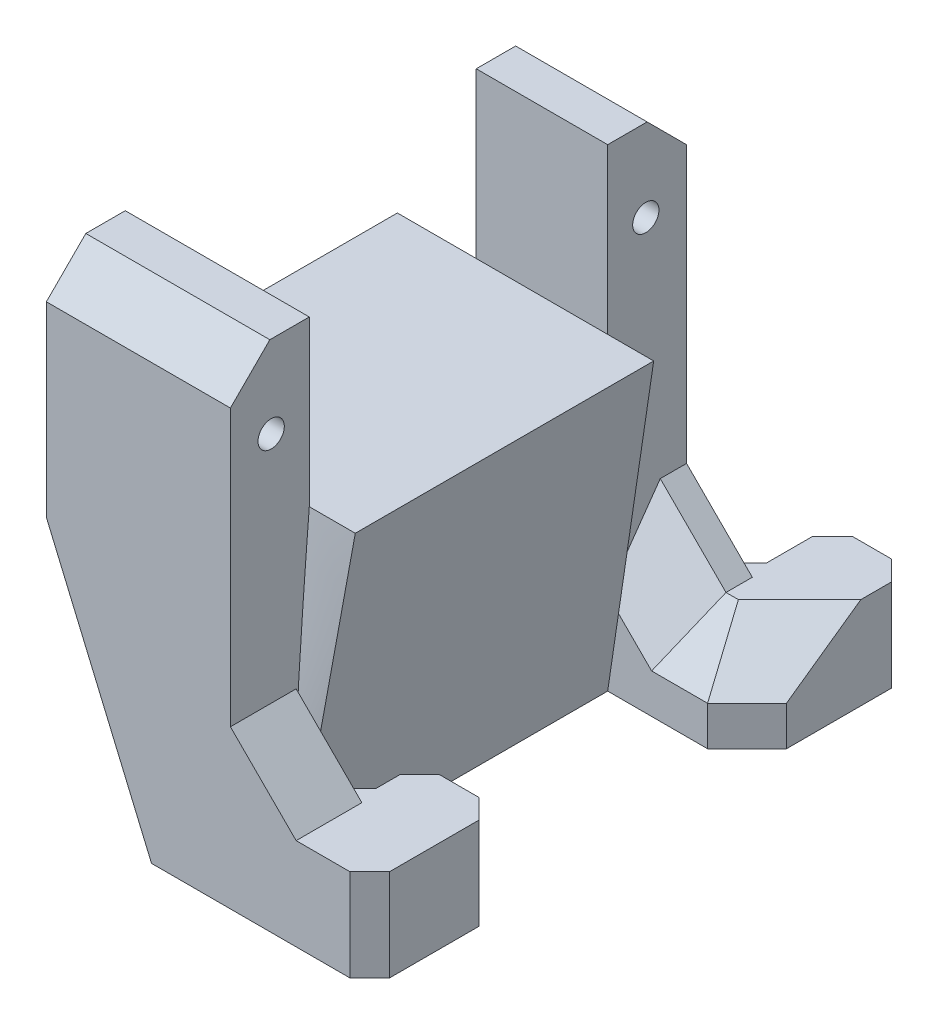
ISO-10303-21;
HEADER;
FILE_DESCRIPTION(('STEP AP214'),'2;1');
FILE_NAME('part.step','',(''),(''),'','','');
FILE_SCHEMA(('AUTOMOTIVE_DESIGN { 1 0 10303 214 1 1 1 1 }'));
ENDSEC;
DATA;
#1=APPLICATION_CONTEXT('core data for automotive mechanical design processes');
#2=APPLICATION_PROTOCOL_DEFINITION('international standard','automotive_design',2000,#1);
#3=PRODUCT_CONTEXT('',#1,'mechanical');
#4=PRODUCT('Part','Part','',(#3));
#5=PRODUCT_RELATED_PRODUCT_CATEGORY('part','',(#4));
#6=PRODUCT_DEFINITION_FORMATION('','',#4);
#7=PRODUCT_DEFINITION_CONTEXT('part definition',#1,'design');
#8=PRODUCT_DEFINITION('design','',#6,#7);
#9=PRODUCT_DEFINITION_SHAPE('','',#8);
#10=(LENGTH_UNIT() NAMED_UNIT(*) SI_UNIT(.MILLI.,.METRE.));
#11=(NAMED_UNIT(*) PLANE_ANGLE_UNIT() SI_UNIT($,.RADIAN.));
#12=(NAMED_UNIT(*) SI_UNIT($,.STERADIAN.) SOLID_ANGLE_UNIT());
#13=UNCERTAINTY_MEASURE_WITH_UNIT(LENGTH_MEASURE(1.E-05),#10,'distance_accuracy_value','');
#14=(GEOMETRIC_REPRESENTATION_CONTEXT(3) GLOBAL_UNCERTAINTY_ASSIGNED_CONTEXT((#13)) GLOBAL_UNIT_ASSIGNED_CONTEXT((#10,
#11,#12)) REPRESENTATION_CONTEXT('',''));
#15=CARTESIAN_POINT('',(0.,0.,0.));
#16=DIRECTION('',(0.,0.,1.));
#17=DIRECTION('',(1.,0.,0.));
#18=AXIS2_PLACEMENT_3D('',#15,#16,#17);
#19=CARTESIAN_POINT('',(13.6,2.50000000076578E-05,10.55));
#20=DIRECTION('',(0.,-1.,0.));
#21=DIRECTION('',(0.,0.,-1.));
#22=AXIS2_PLACEMENT_3D('',#19,#20,#21);
#23=CYLINDRICAL_SURFACE('',#22,1.);
#24=CARTESIAN_POINT('',(13.6,-36.,10.55));
#25=DIRECTION('',(0.,-1.,0.));
#26=DIRECTION('',(0.,0.,-1.));
#27=AXIS2_PLACEMENT_3D('',#24,#25,#26);
#28=CIRCLE('',#27,1.);
#29=CARTESIAN_POINT('',(13.6,-36.,9.55));
#30=VERTEX_POINT('',#29);
#31=EDGE_CURVE('E1217',#30,#30,#28,.T.);
#32=ORIENTED_EDGE('',*,*,#31,.T.);
#33=EDGE_LOOP('',(#32));
#34=FACE_BOUND('',#33,.T.);
#35=CARTESIAN_POINT('',(13.6,-30.,10.55));
#36=DIRECTION('',(0.,1.,0.));
#37=DIRECTION('',(-1.,0.,0.));
#38=AXIS2_PLACEMENT_3D('',#35,#36,#37);
#39=CIRCLE('',#38,1.);
#40=CARTESIAN_POINT('',(12.6,-30.,10.55));
#41=VERTEX_POINT('',#40);
#42=EDGE_CURVE('E13',#41,#41,#39,.F.);
#43=ORIENTED_EDGE('',*,*,#42,.F.);
#44=EDGE_LOOP('',(#43));
#45=FACE_BOUND('',#44,.T.);
#46=ADVANCED_FACE('F154',(#34,#45),#23,.F.);
#47=CARTESIAN_POINT('',(13.6,2.50000000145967E-05,-20.85));
#48=DIRECTION('',(0.,-1.,0.));
#49=DIRECTION('',(0.,0.,-1.));
#50=AXIS2_PLACEMENT_3D('',#47,#48,#49);
#51=CYLINDRICAL_SURFACE('',#50,1.);
#52=CARTESIAN_POINT('',(13.6,-36.,-20.85));
#53=DIRECTION('',(0.,-1.,0.));
#54=DIRECTION('',(0.,0.,-1.));
#55=AXIS2_PLACEMENT_3D('',#52,#53,#54);
#56=CIRCLE('',#55,1.);
#57=CARTESIAN_POINT('',(13.6,-36.,-21.85));
#58=VERTEX_POINT('',#57);
#59=EDGE_CURVE('E1215',#58,#58,#56,.T.);
#60=ORIENTED_EDGE('',*,*,#59,.T.);
#61=EDGE_LOOP('',(#60));
#62=FACE_BOUND('',#61,.T.);
#63=CARTESIAN_POINT('',(13.6,-30.,-20.85));
#64=DIRECTION('',(0.,1.,0.));
#65=DIRECTION('',(-1.,0.,0.));
#66=AXIS2_PLACEMENT_3D('',#63,#64,#65);
#67=CIRCLE('',#66,1.);
#68=CARTESIAN_POINT('',(12.6,-30.,-20.85));
#69=VERTEX_POINT('',#68);
#70=EDGE_CURVE('E164',#69,#69,#67,.F.);
#71=ORIENTED_EDGE('',*,*,#70,.F.);
#72=EDGE_LOOP('',(#71));
#73=FACE_BOUND('',#72,.T.);
#74=ADVANCED_FACE('F536',(#62,#73),#51,.F.);
#75=CARTESIAN_POINT('',(11.0000000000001,-29.,12.35));
#76=DIRECTION('',(0.,1.,0.));
#77=DIRECTION('',(-1.,0.,0.));
#78=AXIS2_PLACEMENT_3D('',#75,#76,#77);
#79=PLANE('',#78);
#80=DIRECTION('',(-0.707106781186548,0.,0.707106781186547));
#81=VECTOR('',#80,1.);
#82=CARTESIAN_POINT('',(16.6,-29.,15.85));
#83=LINE('',#82,#81);
#84=CARTESIAN_POINT('',(16.6,-29.,15.85));
#85=VERTEX_POINT('',#84);
#86=CARTESIAN_POINT('',(15.1,-29.,17.35));
#87=VERTEX_POINT('',#86);
#88=EDGE_CURVE('E962',#85,#87,#83,.T.);
#89=ORIENTED_EDGE('',*,*,#88,.F.);
#90=DIRECTION('',(0.,0.,1.));
#91=VECTOR('',#90,1.);
#92=CARTESIAN_POINT('',(16.6,-29.,15.85));
#93=LINE('',#92,#91);
#94=CARTESIAN_POINT('',(16.6,-29.,9.05000000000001));
#95=VERTEX_POINT('',#94);
#96=EDGE_CURVE('E959',#95,#85,#93,.T.);
#97=ORIENTED_EDGE('',*,*,#96,.F.);
#98=DIRECTION('',(0.707106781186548,0.,0.707106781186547));
#99=VECTOR('',#98,1.);
#100=CARTESIAN_POINT('',(15.1,-29.,7.55000000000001));
#101=LINE('',#100,#99);
#102=CARTESIAN_POINT('',(15.1,-29.,7.55000000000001));
#103=VERTEX_POINT('',#102);
#104=EDGE_CURVE('E956',#103,#95,#101,.T.);
#105=ORIENTED_EDGE('',*,*,#104,.F.);
#106=DIRECTION('',(1.,0.,0.));
#107=VECTOR('',#106,1.);
#108=CARTESIAN_POINT('',(12.1,-29.,7.55000000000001));
#109=LINE('',#108,#107);
#110=CARTESIAN_POINT('',(12.1,-29.,7.55000000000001));
#111=VERTEX_POINT('',#110);
#112=EDGE_CURVE('E953',#111,#103,#109,.T.);
#113=ORIENTED_EDGE('',*,*,#112,.F.);
#114=DIRECTION('',(0.707106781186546,0.,-0.707106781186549));
#115=VECTOR('',#114,1.);
#116=CARTESIAN_POINT('',(10.6,-29.,9.05000000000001));
#117=LINE('',#116,#115);
#118=CARTESIAN_POINT('',(10.6,-29.,9.05000000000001));
#119=VERTEX_POINT('',#118);
#120=EDGE_CURVE('E950',#119,#111,#117,.T.);
#121=ORIENTED_EDGE('',*,*,#120,.F.);
#122=DIRECTION('',(0.,0.,-1.));
#123=VECTOR('',#122,1.);
#124=CARTESIAN_POINT('',(10.6,-29.,10.85));
#125=LINE('',#124,#123);
#126=CARTESIAN_POINT('',(10.6,-29.,10.85));
#127=VERTEX_POINT('',#126);
#128=EDGE_CURVE('E947',#127,#119,#125,.T.);
#129=ORIENTED_EDGE('',*,*,#128,.F.);
#130=DIRECTION('',(0.707106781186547,0.,-0.707106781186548));
#131=VECTOR('',#130,1.);
#132=CARTESIAN_POINT('',(10.6,-29.,10.85));
#133=LINE('',#132,#131);
#134=CARTESIAN_POINT('',(9.10000000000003,-29.,12.35));
#135=VERTEX_POINT('',#134);
#136=EDGE_CURVE('E944',#135,#127,#133,.T.);
#137=ORIENTED_EDGE('',*,*,#136,.F.);
#138=DIRECTION('',(-1.,0.,0.));
#139=VECTOR('',#138,1.);
#140=CARTESIAN_POINT('',(7.1,-29.,12.35));
#141=LINE('',#140,#139);
#142=CARTESIAN_POINT('',(11.0000000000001,-29.,12.35));
#143=VERTEX_POINT('',#142);
#144=EDGE_CURVE('E661',#143,#135,#141,.T.);
#145=ORIENTED_EDGE('',*,*,#144,.F.);
#146=DIRECTION('',(0.,0.,1.));
#147=VECTOR('',#146,1.);
#148=CARTESIAN_POINT('',(11.0000000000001,-29.,12.35));
#149=LINE('',#148,#147);
#150=CARTESIAN_POINT('',(11.0000000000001,-29.,17.35));
#151=VERTEX_POINT('',#150);
#152=EDGE_CURVE('E463',#143,#151,#149,.T.);
#153=ORIENTED_EDGE('',*,*,#152,.T.);
#154=DIRECTION('',(-1.,0.,0.));
#155=VECTOR('',#154,1.);
#156=CARTESIAN_POINT('',(11.0000000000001,-29.,17.35));
#157=LINE('',#156,#155);
#158=EDGE_CURVE('E464',#87,#151,#157,.T.);
#159=ORIENTED_EDGE('',*,*,#158,.F.);
#160=EDGE_LOOP('',(#89,#97,#105,#113,#121,#129,#137,#145,#153,#159));
#161=FACE_BOUND('',#160,.T.);
#162=ADVANCED_FACE('F543',(#161),#79,.T.);
#163=CARTESIAN_POINT('',(6.,-12.5,10.35));
#164=DIRECTION('',(1.,0.,0.));
#165=DIRECTION('',(0.,0.,-1.));
#166=AXIS2_PLACEMENT_3D('',#163,#164,#165);
#167=PLANE('',#166);
#168=DIRECTION('',(0.,-0.707106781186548,-0.707106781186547));
#169=VECTOR('',#168,1.);
#170=CARTESIAN_POINT('',(6.,0.,-14.35));
#171=LINE('',#170,#169);
#172=CARTESIAN_POINT('',(6.,0.,-14.35));
#173=VERTEX_POINT('',#172);
#174=CARTESIAN_POINT('',(6.,-3.00000000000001,-17.35));
#175=VERTEX_POINT('',#174);
#176=EDGE_CURVE('E421',#173,#175,#171,.T.);
#177=ORIENTED_EDGE('',*,*,#176,.F.);
#178=DIRECTION('',(0.,0.,1.));
#179=VECTOR('',#178,1.);
#180=CARTESIAN_POINT('',(6.,0.,-11.35));
#181=LINE('',#180,#179);
#182=CARTESIAN_POINT('',(6.,0.,-11.35));
#183=VERTEX_POINT('',#182);
#184=EDGE_CURVE('E1055',#173,#183,#181,.T.);
#185=ORIENTED_EDGE('',*,*,#184,.T.);
#186=DIRECTION('',(0.,-1.,0.));
#187=VECTOR('',#186,1.);
#188=CARTESIAN_POINT('',(6.,-12.5,-11.35));
#189=LINE('',#188,#187);
#190=CARTESIAN_POINT('',(6.,-12.5,-11.35));
#191=VERTEX_POINT('',#190);
#192=EDGE_CURVE('E1053',#183,#191,#189,.T.);
#193=ORIENTED_EDGE('',*,*,#192,.T.);
#194=CARTESIAN_POINT('',(6.,-36.,-11.35));
#195=CARTESIAN_POINT('',(6.,-35.8180285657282,-11.3770863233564));
#196=CARTESIAN_POINT('',(6.,-35.6357740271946,-11.4022004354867));
#197=CARTESIAN_POINT('',(6.,-35.2708351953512,-11.4489451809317));
#198=CARTESIAN_POINT('',(6.,-35.0881509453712,-11.4705761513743));
#199=CARTESIAN_POINT('',(6.,-34.7226207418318,-11.5108022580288));
#200=CARTESIAN_POINT('',(6.,-34.5397750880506,-11.5294001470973));
#201=CARTESIAN_POINT('',(6.,-34.1738310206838,-11.5639527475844));
#202=CARTESIAN_POINT('',(6.,-33.990732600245,-11.57990738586));
#203=CARTESIAN_POINT('',(6.,-33.4412314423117,-11.6242925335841));
#204=CARTESIAN_POINT('',(6.,-33.0745471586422,-11.6492523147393));
#205=CARTESIAN_POINT('',(6.,-32.3413111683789,-11.6919012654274));
#206=CARTESIAN_POINT('',(6.,-31.9747600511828,-11.7096010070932));
#207=CARTESIAN_POINT('',(6.,-31.2413537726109,-11.7392453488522));
#208=CARTESIAN_POINT('',(6.,-30.8744985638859,-11.7511887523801));
#209=CARTESIAN_POINT('',(6.,-30.140644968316,-11.77041819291));
#210=CARTESIAN_POINT('',(6.,-29.7736465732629,-11.7777039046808));
#211=CARTESIAN_POINT('',(6.,-29.0408009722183,-11.7884389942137));
#212=CARTESIAN_POINT('',(6.,-28.674953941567,-11.7919008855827));
#213=CARTESIAN_POINT('',(6.,-27.9432777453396,-11.7956762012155));
#214=CARTESIAN_POINT('',(6.,-27.5774485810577,-11.7959899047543));
#215=CARTESIAN_POINT('',(6.,-26.8458063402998,-11.793977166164));
#216=CARTESIAN_POINT('',(6.,-26.4799932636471,-11.791650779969));
#217=CARTESIAN_POINT('',(6.,-25.7481234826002,-11.7847599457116));
#218=CARTESIAN_POINT('',(6.,-25.3820667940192,-11.7801938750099));
#219=CARTESIAN_POINT('',(6.,-24.6499753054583,-11.7691497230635));
#220=CARTESIAN_POINT('',(6.,-24.2839405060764,-11.7626716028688));
#221=CARTESIAN_POINT('',(6.,-23.5519013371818,-11.7480694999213));
#222=CARTESIAN_POINT('',(6.,-23.185896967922,-11.7399455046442));
#223=CARTESIAN_POINT('',(6.,-22.3894125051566,-11.720713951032));
#224=CARTESIAN_POINT('',(6.,-21.9589390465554,-11.7093329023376));
#225=CARTESIAN_POINT('',(6.,-21.0980425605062,-11.6848903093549));
#226=CARTESIAN_POINT('',(6.,-20.6676195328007,-11.6718287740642));
#227=CARTESIAN_POINT('',(6.,-19.8068192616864,-11.6442615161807));
#228=CARTESIAN_POINT('',(6.,-19.3764420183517,-11.6297557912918));
#229=CARTESIAN_POINT('',(6.,-18.5157301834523,-11.5994944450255));
#230=CARTESIAN_POINT('',(6.,-18.0853955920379,-11.5837388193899));
#231=CARTESIAN_POINT('',(6.,-17.225411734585,-11.5511630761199));
#232=CARTESIAN_POINT('',(6.,-16.7957624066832,-11.5343445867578));
#233=CARTESIAN_POINT('',(6.,-15.9365032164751,-11.4997556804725));
#234=CARTESIAN_POINT('',(6.,-15.5068933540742,-11.481985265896));
#235=CARTESIAN_POINT('',(6.,-14.6477133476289,-11.4456061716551));
#236=CARTESIAN_POINT('',(6.,-14.2181432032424,-11.4269975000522));
#237=CARTESIAN_POINT('',(6.,-13.3590436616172,-11.3890347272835));
#238=CARTESIAN_POINT('',(6.,-12.9295142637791,-11.3696806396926));
#239=CARTESIAN_POINT('',(6.,-12.5,-11.35));
#240=B_SPLINE_CURVE_WITH_KNOTS('',3,(#194,#195,#196,#197,#198,#199,#200,#201,#202,#203,#204,
#205,#206,#207,#208,#209,#210,#211,#212,#213,#214,#215,#216,#217,#218,#219,#220,#221,#222,#223,
#224,#225,#226,#227,#228,#229,#230,#231,#232,#233,#234,#235,#236,#237,#238,#239),.UNSPECIFIED.,
.F.,.F.,(4,2,2,2,2,2,2,2,2,2,2,2,2,2,2,2,2,2,2,2,2,2,4),(0.,0.551903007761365,1.1037525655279,
1.65509843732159,2.20645956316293,3.30895366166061,4.40983654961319,5.51094817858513,
6.61213668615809,7.70971073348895,8.80718741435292,9.90464084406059,11.0028905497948,
12.1011626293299,13.1994430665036,14.4913107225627,15.7831714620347,17.0750342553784,
18.3669014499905,19.6568353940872,20.9467661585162,22.2366845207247,23.5265794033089),.UNSPECIFIED.);
#241=CARTESIAN_POINT('',(6.,-29.0376361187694,-11.7878533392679));
#242=VERTEX_POINT('',#241);
#243=EDGE_CURVE('E171',#242,#191,#240,.T.);
#244=ORIENTED_EDGE('',*,*,#243,.F.);
#245=DIRECTION('',(0.,0.816496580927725,-0.577350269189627));
#246=VECTOR('',#245,1.);
#247=CARTESIAN_POINT('',(6.,-24.,-15.35));
#248=LINE('',#247,#246);
#249=CARTESIAN_POINT('',(6.,-24.,-15.35));
#250=VERTEX_POINT('',#249);
#251=EDGE_CURVE('E816',#242,#250,#248,.T.);
#252=ORIENTED_EDGE('',*,*,#251,.T.);
#253=DIRECTION('',(0.,0.,-1.));
#254=VECTOR('',#253,1.);
#255=CARTESIAN_POINT('',(6.,-24.,-11.35));
#256=LINE('',#255,#254);
#257=CARTESIAN_POINT('',(6.,-24.,-17.35));
#258=VERTEX_POINT('',#257);
#259=EDGE_CURVE('E458',#250,#258,#256,.T.);
#260=ORIENTED_EDGE('',*,*,#259,.T.);
#261=DIRECTION('',(0.,1.,0.));
#262=VECTOR('',#261,1.);
#263=CARTESIAN_POINT('',(6.,0.,-17.35));
#264=LINE('',#263,#262);
#265=EDGE_CURVE('E478',#258,#175,#264,.T.);
#266=ORIENTED_EDGE('',*,*,#265,.T.);
#267=EDGE_LOOP('',(#177,#185,#193,#244,#252,#260,#266));
#268=FACE_BOUND('',#267,.T.);
#269=CARTESIAN_POINT('',(6.,-6.25,-14.25));
#270=DIRECTION('',(1.,0.,0.));
#271=DIRECTION('',(0.,0.,-1.));
#272=AXIS2_PLACEMENT_3D('',#269,#270,#271);
#273=CIRCLE('',#272,1.);
#274=CARTESIAN_POINT('',(6.,-6.25,-15.25));
#275=VERTEX_POINT('',#274);
#276=EDGE_CURVE('E470',#275,#275,#273,.T.);
#277=ORIENTED_EDGE('',*,*,#276,.F.);
#278=EDGE_LOOP('',(#277));
#279=FACE_BOUND('',#278,.T.);
#280=ADVANCED_FACE('F679',(#268,#279),#167,.T.);
#281=DIRECTION('',(0.,0.707106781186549,-0.707106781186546));
#282=VECTOR('',#281,1.);
#283=CARTESIAN_POINT('',(6.,0.,14.35));
#284=LINE('',#283,#282);
#285=CARTESIAN_POINT('',(6.,-3.00000000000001,17.35));
#286=VERTEX_POINT('',#285);
#287=CARTESIAN_POINT('',(6.,0.,14.35));
#288=VERTEX_POINT('',#287);
#289=EDGE_CURVE('E1166',#286,#288,#284,.T.);
#290=ORIENTED_EDGE('',*,*,#289,.F.);
#291=DIRECTION('',(0.,-1.,0.));
#292=VECTOR('',#291,1.);
#293=CARTESIAN_POINT('',(6.,-36.,17.35));
#294=LINE('',#293,#292);
#295=CARTESIAN_POINT('',(6.,-24.,17.35));
#296=VERTEX_POINT('',#295);
#297=EDGE_CURVE('E480',#286,#296,#294,.T.);
#298=ORIENTED_EDGE('',*,*,#297,.T.);
#299=DIRECTION('',(0.,0.,1.));
#300=VECTOR('',#299,1.);
#301=CARTESIAN_POINT('',(6.,-24.,12.35));
#302=LINE('',#301,#300);
#303=CARTESIAN_POINT('',(6.,-24.,12.35));
#304=VERTEX_POINT('',#303);
#305=EDGE_CURVE('E469',#304,#296,#302,.T.);
#306=ORIENTED_EDGE('',*,*,#305,.F.);
#307=DIRECTION('',(0.,-1.,0.));
#308=VECTOR('',#307,1.);
#309=CARTESIAN_POINT('',(6.,-24.,12.35));
#310=LINE('',#309,#308);
#311=CARTESIAN_POINT('',(6.,-27.2822580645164,12.35));
#312=VERTEX_POINT('',#311);
#313=EDGE_CURVE('E448',#304,#312,#310,.T.);
#314=ORIENTED_EDGE('',*,*,#313,.T.);
#315=CARTESIAN_POINT('',(6.,-12.5,11.35));
#316=CARTESIAN_POINT('',(6.,-13.0254348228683,11.3924197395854));
#317=CARTESIAN_POINT('',(6.,-13.550902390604,11.4344374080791));
#318=CARTESIAN_POINT('',(6.,-14.6019161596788,11.5175211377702));
#319=CARTESIAN_POINT('',(6.,-15.1274623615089,11.558587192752));
#320=CARTESIAN_POINT('',(6.,-16.1786404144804,11.6396197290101));
#321=CARTESIAN_POINT('',(6.,-16.7042722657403,11.6795862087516));
#322=CARTESIAN_POINT('',(6.,-17.7560958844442,11.7582641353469));
#323=CARTESIAN_POINT('',(6.,-18.2822877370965,11.7969744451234));
#324=CARTESIAN_POINT('',(6.,-19.3347814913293,11.8728684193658));
#325=CARTESIAN_POINT('',(6.,-19.8610833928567,11.9100520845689));
#326=CARTESIAN_POINT('',(6.,-20.9138156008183,11.9825980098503));
#327=CARTESIAN_POINT('',(6.,-21.4402459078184,12.0179602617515));
#328=CARTESIAN_POINT('',(6.,-22.3555945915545,12.0775256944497));
#329=CARTESIAN_POINT('',(6.,-22.7444803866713,12.1022291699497));
#330=CARTESIAN_POINT('',(6.,-23.5223360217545,12.1502433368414));
#331=CARTESIAN_POINT('',(6.,-23.9113058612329,12.1735540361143));
#332=CARTESIAN_POINT('',(6.,-24.6893336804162,12.2185498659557));
#333=CARTESIAN_POINT('',(6.,-25.0783916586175,12.2402350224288));
#334=CARTESIAN_POINT('',(6.,-25.8564214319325,12.2816820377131));
#335=CARTESIAN_POINT('',(6.,-26.2453931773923,12.3014448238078));
#336=CARTESIAN_POINT('',(6.,-27.02345250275,12.3386996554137));
#337=CARTESIAN_POINT('',(6.,-27.4125400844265,12.356191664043));
#338=CARTESIAN_POINT('',(6.,-28.1908558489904,12.3884498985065));
#339=CARTESIAN_POINT('',(6.,-28.5800840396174,12.4032159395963));
#340=CARTESIAN_POINT('',(6.,-29.359745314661,12.4294713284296));
#341=CARTESIAN_POINT('',(6.,-29.7501787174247,12.4409513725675));
#342=CARTESIAN_POINT('',(6.,-30.531127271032,12.4598066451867));
#343=CARTESIAN_POINT('',(6.,-30.9216424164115,12.4671820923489));
#344=CARTESIAN_POINT('',(6.,-31.7026775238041,12.4767971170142));
#345=CARTESIAN_POINT('',(6.,-32.0931974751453,12.4790375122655));
#346=CARTESIAN_POINT('',(6.,-32.8746393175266,12.4769915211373));
#347=CARTESIAN_POINT('',(6.,-33.2655612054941,12.4726983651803));
#348=CARTESIAN_POINT('',(6.,-33.8518331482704,12.4598696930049));
#349=CARTESIAN_POINT('',(6.,-34.0472537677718,12.4545279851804));
#350=CARTESIAN_POINT('',(6.,-34.4380092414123,12.4413840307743));
#351=CARTESIAN_POINT('',(6.,-34.6333440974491,12.4335818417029));
#352=CARTESIAN_POINT('',(6.,-35.0240212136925,12.4151343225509));
#353=CARTESIAN_POINT('',(6.,-35.2193633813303,12.4044869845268));
#354=CARTESIAN_POINT('',(6.,-35.6098523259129,12.3798627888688));
#355=CARTESIAN_POINT('',(6.,-35.8049990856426,12.3658856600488));
#356=CARTESIAN_POINT('',(6.,-36.,12.35));
#357=B_SPLINE_CURVE_WITH_KNOTS('',3,(#315,#316,#317,#318,#319,#320,#321,#322,#323,#324,#325,
#326,#327,#328,#329,#330,#331,#332,#333,#334,#335,#336,#337,#338,#339,#340,#341,#342,#343,#344,
#345,#346,#347,#348,#349,#350,#351,#352,#353,#354,#355,#356),.UNSPECIFIED.,.F.,.F.,(4,2,2,2,2,2,
2,2,2,2,2,2,2,2,2,2,2,2,2,2,4),(0.,1.5814333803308,3.16287708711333,4.74432300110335,
6.32716261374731,7.91000146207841,9.49284741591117,10.6618542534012,11.830854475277,
12.9998360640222,14.1682509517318,15.3366848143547,16.5051978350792,17.6769872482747,
18.8487142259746,20.0202545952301,21.1930096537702,21.7794779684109,22.3659325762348,
22.9528021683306,23.5397195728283),.UNSPECIFIED.);
#358=CARTESIAN_POINT('',(6.,-12.5,11.35));
#359=VERTEX_POINT('',#358);
#360=EDGE_CURVE('E577',#359,#312,#357,.T.);
#361=ORIENTED_EDGE('',*,*,#360,.F.);
#362=DIRECTION('',(0.,1.,0.));
#363=VECTOR('',#362,1.);
#364=CARTESIAN_POINT('',(6.,0.,11.35));
#365=LINE('',#364,#363);
#366=CARTESIAN_POINT('',(6.,0.,11.35));
#367=VERTEX_POINT('',#366);
#368=EDGE_CURVE('E1041',#359,#367,#365,.T.);
#369=ORIENTED_EDGE('',*,*,#368,.T.);
#370=DIRECTION('',(0.,0.,1.));
#371=VECTOR('',#370,1.);
#372=CARTESIAN_POINT('',(6.,0.,17.35));
#373=LINE('',#372,#371);
#374=EDGE_CURVE('E1052',#367,#288,#373,.T.);
#375=ORIENTED_EDGE('',*,*,#374,.T.);
#376=EDGE_LOOP('',(#290,#298,#306,#314,#361,#369,#375));
#377=FACE_BOUND('',#376,.T.);
#378=CARTESIAN_POINT('',(6.,-6.25,14.25));
#379=DIRECTION('',(1.,0.,0.));
#380=DIRECTION('',(0.,0.,-1.));
#381=AXIS2_PLACEMENT_3D('',#378,#379,#380);
#382=CIRCLE('',#381,1.);
#383=CARTESIAN_POINT('',(6.,-6.25,13.25));
#384=VERTEX_POINT('',#383);
#385=EDGE_CURVE('E473',#384,#384,#382,.T.);
#386=ORIENTED_EDGE('',*,*,#385,.F.);
#387=EDGE_LOOP('',(#386));
#388=FACE_BOUND('',#387,.T.);
#389=ADVANCED_FACE('F521',(#377,#388),#167,.T.);
#390=CARTESIAN_POINT('',(6.,-36.,17.35));
#391=DIRECTION('',(0.,0.,-1.));
#392=DIRECTION('',(0.,1.,0.));
#393=AXIS2_PLACEMENT_3D('',#390,#391,#392);
#394=PLANE('',#393);
#395=DIRECTION('',(0.,1.,0.));
#396=VECTOR('',#395,1.);
#397=CARTESIAN_POINT('',(-8.,0.,17.35));
#398=LINE('',#397,#396);
#399=CARTESIAN_POINT('',(-8.,-17.2,17.3500025));
#400=VERTEX_POINT('',#399);
#401=CARTESIAN_POINT('',(-8.,-3.00000000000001,17.35));
#402=VERTEX_POINT('',#401);
#403=EDGE_CURVE('E420',#400,#402,#398,.T.);
#404=ORIENTED_EDGE('',*,*,#403,.F.);
#405=DIRECTION('',(0.391555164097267,-0.920154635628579,0.));
#406=VECTOR('',#405,1.);
#407=CARTESIAN_POINT('',(0.919892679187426,-38.1617477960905,17.35));
#408=LINE('',#407,#406);
#409=CARTESIAN_POINT('',(0.,-36.,17.35));
#410=VERTEX_POINT('',#409);
#411=EDGE_CURVE('E403',#400,#410,#408,.T.);
#412=ORIENTED_EDGE('',*,*,#411,.T.);
#413=DIRECTION('',(-1.,0.,0.));
#414=VECTOR('',#413,1.);
#415=CARTESIAN_POINT('',(6.,-36.,17.35));
#416=LINE('',#415,#414);
#417=CARTESIAN_POINT('',(15.1,-36.,17.35));
#418=VERTEX_POINT('',#417);
#419=EDGE_CURVE('E418',#418,#410,#416,.T.);
#420=ORIENTED_EDGE('',*,*,#419,.F.);
#421=DIRECTION('',(0.,1.,0.));
#422=VECTOR('',#421,1.);
#423=CARTESIAN_POINT('',(15.1,-36.0001625,17.35));
#424=LINE('',#423,#422);
#425=EDGE_CURVE('E964',#418,#87,#424,.T.);
#426=ORIENTED_EDGE('',*,*,#425,.T.);
#427=ORIENTED_EDGE('',*,*,#158,.T.);
#428=DIRECTION('',(-0.707106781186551,0.707106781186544,0.));
#429=VECTOR('',#428,1.);
#430=CARTESIAN_POINT('',(11.0000000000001,-29.,17.35));
#431=LINE('',#430,#429);
#432=EDGE_CURVE('E453',#151,#296,#431,.T.);
#433=ORIENTED_EDGE('',*,*,#432,.T.);
#434=ORIENTED_EDGE('',*,*,#297,.F.);
#435=DIRECTION('',(1.,0.,0.));
#436=VECTOR('',#435,1.);
#437=CARTESIAN_POINT('',(-10.0001,-3.00000000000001,17.35));
#438=LINE('',#437,#436);
#439=EDGE_CURVE('E1169',#402,#286,#438,.T.);
#440=ORIENTED_EDGE('',*,*,#439,.F.);
#441=EDGE_LOOP('',(#404,#412,#420,#426,#427,#433,#434,#440));
#442=FACE_BOUND('',#441,.T.);
#443=ADVANCED_FACE('F416',(#442),#394,.F.);
#444=CARTESIAN_POINT('',(6.,-36.,-17.35));
#445=DIRECTION('',(0.,1.,0.));
#446=DIRECTION('',(0.,0.,1.));
#447=AXIS2_PLACEMENT_3D('',#444,#445,#446);
#448=PLANE('',#447);
#449=ORIENTED_EDGE('',*,*,#419,.T.);
#450=DIRECTION('',(0.,0.,-1.));
#451=VECTOR('',#450,1.);
#452=CARTESIAN_POINT('',(0.,-36.,17.35005));
#453=LINE('',#452,#451);
#454=CARTESIAN_POINT('',(0.,-36.,11.35));
#455=VERTEX_POINT('',#454);
#456=EDGE_CURVE('E400',#410,#455,#453,.T.);
#457=ORIENTED_EDGE('',*,*,#456,.T.);
#458=CARTESIAN_POINT('',(0.,-36.,11.35));
#459=DIRECTION('',(0.,0.,-1.));
#460=VECTOR('',#459,1.);
#461=LINE('',#458,#460);
#462=CARTESIAN_POINT('',(0.,-36.,-11.35000625));
#463=VERTEX_POINT('',#462);
#464=EDGE_CURVE('E406',#455,#463,#461,.T.);
#465=ORIENTED_EDGE('',*,*,#464,.T.);
#466=CARTESIAN_POINT('',(0.,-36.,-17.35));
#467=VERTEX_POINT('',#466);
#468=EDGE_CURVE('E411',#463,#467,#453,.T.);
#469=ORIENTED_EDGE('',*,*,#468,.T.);
#470=DIRECTION('',(1.,0.,0.));
#471=VECTOR('',#470,1.);
#472=CARTESIAN_POINT('',(-8.,-36.,-17.3500000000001));
#473=LINE('',#472,#471);
#474=CARTESIAN_POINT('',(9.10000000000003,-36.,-17.35));
#475=VERTEX_POINT('',#474);
#476=EDGE_CURVE('E487',#467,#475,#473,.T.);
#477=ORIENTED_EDGE('',*,*,#476,.T.);
#478=DIRECTION('',(0.707106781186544,0.,-0.707106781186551));
#479=VECTOR('',#478,1.);
#480=CARTESIAN_POINT('',(7.55000000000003,-36.,-15.8));
#481=LINE('',#480,#479);
#482=CARTESIAN_POINT('',(10.6,-36.,-18.85));
#483=VERTEX_POINT('',#482);
#484=EDGE_CURVE('E997',#475,#483,#481,.T.);
#485=ORIENTED_EDGE('',*,*,#484,.T.);
#486=DIRECTION('',(0.,0.,-1.));
#487=VECTOR('',#486,1.);
#488=CARTESIAN_POINT('',(10.6,-36.,-17.35));
#489=LINE('',#488,#487);
#490=CARTESIAN_POINT('',(10.6,-36.,-22.35));
#491=VERTEX_POINT('',#490);
#492=EDGE_CURVE('E915',#483,#491,#489,.T.);
#493=ORIENTED_EDGE('',*,*,#492,.T.);
#494=DIRECTION('',(0.707106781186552,0.,-0.707106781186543));
#495=VECTOR('',#494,1.);
#496=CARTESIAN_POINT('',(5.79999999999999,-36.,-17.55));
#497=LINE('',#496,#495);
#498=CARTESIAN_POINT('',(12.1,-36.,-23.85));
#499=VERTEX_POINT('',#498);
#500=EDGE_CURVE('E1000',#491,#499,#497,.T.);
#501=ORIENTED_EDGE('',*,*,#500,.T.);
#502=DIRECTION('',(1.,0.,0.));
#503=VECTOR('',#502,1.);
#504=CARTESIAN_POINT('',(6.,-36.,-23.85));
#505=LINE('',#504,#503);
#506=CARTESIAN_POINT('',(15.1,-36.,-23.85));
#507=VERTEX_POINT('',#506);
#508=EDGE_CURVE('E1003',#499,#507,#505,.T.);
#509=ORIENTED_EDGE('',*,*,#508,.T.);
#510=DIRECTION('',(0.707106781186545,0.,0.70710678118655));
#511=VECTOR('',#510,1.);
#512=CARTESIAN_POINT('',(13.8,-36.,-25.15));
#513=LINE('',#512,#511);
#514=CARTESIAN_POINT('',(16.6,-36.,-22.35));
#515=VERTEX_POINT('',#514);
#516=EDGE_CURVE('E1006',#507,#515,#513,.T.);
#517=ORIENTED_EDGE('',*,*,#516,.T.);
#518=DIRECTION('',(0.,0.,1.));
#519=VECTOR('',#518,1.);
#520=CARTESIAN_POINT('',(16.6,-36.,-17.35));
#521=LINE('',#520,#519);
#522=CARTESIAN_POINT('',(16.6,-36.,-14.35));
#523=VERTEX_POINT('',#522);
#524=EDGE_CURVE('E1009',#515,#523,#521,.T.);
#525=ORIENTED_EDGE('',*,*,#524,.T.);
#526=DIRECTION('',(-0.707106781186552,0.,0.707106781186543));
#527=VECTOR('',#526,1.);
#528=CARTESIAN_POINT('',(12.8,-36.,-10.55));
#529=LINE('',#528,#527);
#530=CARTESIAN_POINT('',(13.6,-36.,-11.35));
#531=VERTEX_POINT('',#530);
#532=EDGE_CURVE('E966',#523,#531,#529,.T.);
#533=ORIENTED_EDGE('',*,*,#532,.T.);
#534=DIRECTION('',(-1.,0.,0.));
#535=VECTOR('',#534,1.);
#536=CARTESIAN_POINT('',(52.,-36.,-11.35));
#537=LINE('',#536,#535);
#538=CARTESIAN_POINT('',(6.,-36.,-11.35));
#539=VERTEX_POINT('',#538);
#540=EDGE_CURVE('E660',#531,#539,#537,.T.);
#541=ORIENTED_EDGE('',*,*,#540,.T.);
#542=DIRECTION('',(0.,0.,1.));
#543=VECTOR('',#542,1.);
#544=CARTESIAN_POINT('',(6.,-36.,-11.35));
#545=LINE('',#544,#543);
#546=CARTESIAN_POINT('',(6.,-36.,12.35));
#547=VERTEX_POINT('',#546);
#548=EDGE_CURVE('E482',#547,#539,#545,.F.);
#549=ORIENTED_EDGE('',*,*,#548,.F.);
#550=DIRECTION('',(1.,0.,0.));
#551=VECTOR('',#550,1.);
#552=CARTESIAN_POINT('',(6.,-36.,12.35));
#553=LINE('',#552,#551);
#554=CARTESIAN_POINT('',(9.10000000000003,-36.,12.35));
#555=VERTEX_POINT('',#554);
#556=EDGE_CURVE('E452',#547,#555,#553,.T.);
#557=ORIENTED_EDGE('',*,*,#556,.T.);
#558=DIRECTION('',(0.707106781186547,0.,-0.707106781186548));
#559=VECTOR('',#558,1.);
#560=CARTESIAN_POINT('',(22.4,-36.,-0.950000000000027));
#561=LINE('',#560,#559);
#562=CARTESIAN_POINT('',(10.6,-36.,10.85));
#563=VERTEX_POINT('',#562);
#564=EDGE_CURVE('E994',#555,#563,#561,.T.);
#565=ORIENTED_EDGE('',*,*,#564,.T.);
#566=DIRECTION('',(0.,0.,-1.));
#567=VECTOR('',#566,1.);
#568=CARTESIAN_POINT('',(10.6,-36.,-17.35));
#569=LINE('',#568,#567);
#570=CARTESIAN_POINT('',(10.6,-36.,9.05000000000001));
#571=VERTEX_POINT('',#570);
#572=EDGE_CURVE('E1012',#563,#571,#569,.T.);
#573=ORIENTED_EDGE('',*,*,#572,.T.);
#574=DIRECTION('',(0.707106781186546,0.,-0.707106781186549));
#575=VECTOR('',#574,1.);
#576=CARTESIAN_POINT('',(21.5,-36.,-1.85000000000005));
#577=LINE('',#576,#575);
#578=CARTESIAN_POINT('',(12.1,-36.,7.55000000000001));
#579=VERTEX_POINT('',#578);
#580=EDGE_CURVE('E1015',#571,#579,#577,.T.);
#581=ORIENTED_EDGE('',*,*,#580,.T.);
#582=DIRECTION('',(1.,0.,0.));
#583=VECTOR('',#582,1.);
#584=CARTESIAN_POINT('',(5.99999999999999,-36.,7.55));
#585=LINE('',#584,#583);
#586=CARTESIAN_POINT('',(15.1,-36.,7.55000000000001));
#587=VERTEX_POINT('',#586);
#588=EDGE_CURVE('E1018',#579,#587,#585,.T.);
#589=ORIENTED_EDGE('',*,*,#588,.T.);
#590=DIRECTION('',(0.707106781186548,0.,0.707106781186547));
#591=VECTOR('',#590,1.);
#592=CARTESIAN_POINT('',(-1.89999999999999,-36.,-9.45000000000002));
#593=LINE('',#592,#591);
#594=CARTESIAN_POINT('',(16.6,-36.,9.05000000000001));
#595=VERTEX_POINT('',#594);
#596=EDGE_CURVE('E1021',#587,#595,#593,.T.);
#597=ORIENTED_EDGE('',*,*,#596,.T.);
#598=DIRECTION('',(0.,0.,1.));
#599=VECTOR('',#598,1.);
#600=CARTESIAN_POINT('',(16.6,-36.,-17.35));
#601=LINE('',#600,#599);
#602=CARTESIAN_POINT('',(16.6,-36.,15.85));
#603=VERTEX_POINT('',#602);
#604=EDGE_CURVE('E1023',#595,#603,#601,.T.);
#605=ORIENTED_EDGE('',*,*,#604,.T.);
#606=DIRECTION('',(-0.707106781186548,0.,0.707106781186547));
#607=VECTOR('',#606,1.);
#608=CARTESIAN_POINT('',(27.9,-36.,4.55000000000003));
#609=LINE('',#608,#607);
#610=EDGE_CURVE('E428',#603,#418,#609,.T.);
#611=ORIENTED_EDGE('',*,*,#610,.T.);
#612=EDGE_LOOP('',(#449,#457,#465,#469,#477,#485,#493,#501,#509,#517,#525,#533,#541,#549,#557,
#565,#573,#581,#589,#597,#605,#611));
#613=FACE_BOUND('',#612,.T.);
#614=ORIENTED_EDGE('',*,*,#31,.F.);
#615=EDGE_LOOP('',(#614));
#616=FACE_BOUND('',#615,.T.);
#617=ORIENTED_EDGE('',*,*,#59,.F.);
#618=EDGE_LOOP('',(#617));
#619=FACE_BOUND('',#618,.T.);
#620=ADVANCED_FACE('F425',(#613,#616,#619),#448,.F.);
#621=CARTESIAN_POINT('',(6.,0.,-17.35));
#622=DIRECTION('',(0.,0.,1.));
#623=DIRECTION('',(0.,-1.,0.));
#624=AXIS2_PLACEMENT_3D('',#621,#622,#623);
#625=PLANE('',#624);
#626=ORIENTED_EDGE('',*,*,#476,.F.);
#627=DIRECTION('',(-0.391555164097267,0.920154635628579,0.));
#628=VECTOR('',#627,1.);
#629=CARTESIAN_POINT('',(-12.0505940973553,-7.68110387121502,-17.35));
#630=LINE('',#629,#628);
#631=CARTESIAN_POINT('',(-4.,-26.6,-17.3500000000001));
#632=VERTEX_POINT('',#631);
#633=EDGE_CURVE('E422',#467,#632,#630,.T.);
#634=ORIENTED_EDGE('',*,*,#633,.T.);
#635=DIRECTION('',(0.,1.,0.));
#636=VECTOR('',#635,1.);
#637=CARTESIAN_POINT('',(-4.,-36.00005,-17.3500000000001));
#638=LINE('',#637,#636);
#639=CARTESIAN_POINT('',(-4.,-3.00000000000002,-17.35));
#640=VERTEX_POINT('',#639);
#641=EDGE_CURVE('E491',#632,#640,#638,.T.);
#642=ORIENTED_EDGE('',*,*,#641,.T.);
#643=DIRECTION('',(1.,0.,0.));
#644=VECTOR('',#643,1.);
#645=CARTESIAN_POINT('',(-10.0001,-3.00000000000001,-17.35));
#646=LINE('',#645,#644);
#647=EDGE_CURVE('E1145',#640,#175,#646,.T.);
#648=ORIENTED_EDGE('',*,*,#647,.T.);
#649=ORIENTED_EDGE('',*,*,#265,.F.);
#650=DIRECTION('',(0.707106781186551,-0.707106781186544,0.));
#651=VECTOR('',#650,1.);
#652=CARTESIAN_POINT('',(6.,-24.,-17.35));
#653=LINE('',#652,#651);
#654=CARTESIAN_POINT('',(11.0000000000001,-29.,-17.35));
#655=VERTEX_POINT('',#654);
#656=EDGE_CURVE('E657',#258,#655,#653,.T.);
#657=ORIENTED_EDGE('',*,*,#656,.T.);
#658=DIRECTION('',(-1.,0.,0.));
#659=VECTOR('',#658,1.);
#660=CARTESIAN_POINT('',(0.,-29.,-17.35));
#661=LINE('',#660,#659);
#662=CARTESIAN_POINT('',(9.10000000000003,-29.,-17.35));
#663=VERTEX_POINT('',#662);
#664=EDGE_CURVE('E429',#655,#663,#661,.T.);
#665=ORIENTED_EDGE('',*,*,#664,.T.);
#666=DIRECTION('',(0.,1.,0.));
#667=VECTOR('',#666,1.);
#668=CARTESIAN_POINT('',(9.10000000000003,-36.0001625,-17.35));
#669=LINE('',#668,#667);
#670=EDGE_CURVE('E919',#475,#663,#669,.T.);
#671=ORIENTED_EDGE('',*,*,#670,.F.);
#672=EDGE_LOOP('',(#626,#634,#642,#648,#649,#657,#665,#671));
#673=FACE_BOUND('',#672,.T.);
#674=ADVANCED_FACE('F517',(#673),#625,.F.);
#675=CARTESIAN_POINT('',(6.,0.,-11.35));
#676=DIRECTION('',(0.,-1.,0.));
#677=DIRECTION('',(0.,0.,-1.));
#678=AXIS2_PLACEMENT_3D('',#675,#676,#677);
#679=PLANE('',#678);
#680=ORIENTED_EDGE('',*,*,#184,.F.);
#681=DIRECTION('',(1.,0.,0.));
#682=VECTOR('',#681,1.);
#683=CARTESIAN_POINT('',(-10.0001,0.,-14.35));
#684=LINE('',#683,#682);
#685=CARTESIAN_POINT('',(-4.,0.,-14.35));
#686=VERTEX_POINT('',#685);
#687=EDGE_CURVE('E1164',#686,#173,#684,.T.);
#688=ORIENTED_EDGE('',*,*,#687,.F.);
#689=DIRECTION('',(0.,0.,-1.));
#690=VECTOR('',#689,1.);
#691=CARTESIAN_POINT('',(-4.,0.,-17.35));
#692=LINE('',#691,#690);
#693=CARTESIAN_POINT('',(-4.,0.,-11.35));
#694=VERTEX_POINT('',#693);
#695=EDGE_CURVE('E664',#694,#686,#692,.T.);
#696=ORIENTED_EDGE('',*,*,#695,.F.);
#697=DIRECTION('',(-1.,0.,0.));
#698=VECTOR('',#697,1.);
#699=CARTESIAN_POINT('',(6.,0.,-11.35));
#700=LINE('',#699,#698);
#701=EDGE_CURVE('E430',#183,#694,#700,.T.);
#702=ORIENTED_EDGE('',*,*,#701,.F.);
#703=EDGE_LOOP('',(#680,#688,#696,#702));
#704=FACE_BOUND('',#703,.T.);
#705=ADVANCED_FACE('F1211',(#704),#679,.F.);
#706=CARTESIAN_POINT('',(6.,-12.5,-11.35));
#707=DIRECTION('',(0.,0.,-1.));
#708=DIRECTION('',(-1.,0.,0.));
#709=AXIS2_PLACEMENT_3D('',#706,#707,#708);
#710=PLANE('',#709);
#711=DIRECTION('',(0.,1.,0.));
#712=VECTOR('',#711,1.);
#713=CARTESIAN_POINT('',(-4.,-36.00005,-11.3500000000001));
#714=LINE('',#713,#712);
#715=CARTESIAN_POINT('',(-4.,-12.5,-11.35));
#716=VERTEX_POINT('',#715);
#717=EDGE_CURVE('E663',#716,#694,#714,.T.);
#718=ORIENTED_EDGE('',*,*,#717,.F.);
#719=DIRECTION('',(1.,0.,0.));
#720=VECTOR('',#719,1.);
#721=CARTESIAN_POINT('',(0.,-12.5,-11.35));
#722=LINE('',#721,#720);
#723=EDGE_CURVE('E436',#191,#716,#722,.F.);
#724=ORIENTED_EDGE('',*,*,#723,.F.);
#725=ORIENTED_EDGE('',*,*,#192,.F.);
#726=ORIENTED_EDGE('',*,*,#701,.T.);
#727=EDGE_LOOP('',(#718,#724,#725,#726));
#728=FACE_BOUND('',#727,.T.);
#729=ADVANCED_FACE('F1087',(#728),#710,.F.);
#730=CARTESIAN_POINT('',(6.,0.,11.35));
#731=DIRECTION('',(0.,0.,1.));
#732=DIRECTION('',(0.,-1.,0.));
#733=AXIS2_PLACEMENT_3D('',#730,#731,#732);
#734=PLANE('',#733);
#735=DIRECTION('',(1.,0.,0.));
#736=VECTOR('',#735,1.);
#737=CARTESIAN_POINT('',(6.,-12.5,11.35));
#738=LINE('',#737,#736);
#739=CARTESIAN_POINT('',(-8.00000625,-12.5,11.35));
#740=VERTEX_POINT('',#739);
#741=EDGE_CURVE('E1047',#359,#740,#738,.F.);
#742=ORIENTED_EDGE('',*,*,#741,.T.);
#743=DIRECTION('',(0.,-1.,0.));
#744=VECTOR('',#743,1.);
#745=CARTESIAN_POINT('',(-8.,-36.,11.35));
#746=LINE('',#745,#744);
#747=CARTESIAN_POINT('',(-8.,0.,11.35));
#748=VERTEX_POINT('',#747);
#749=EDGE_CURVE('E490',#748,#740,#746,.T.);
#750=ORIENTED_EDGE('',*,*,#749,.F.);
#751=DIRECTION('',(-1.,0.,0.));
#752=VECTOR('',#751,1.);
#753=CARTESIAN_POINT('',(6.,0.,11.35));
#754=LINE('',#753,#752);
#755=EDGE_CURVE('E1050',#367,#748,#754,.T.);
#756=ORIENTED_EDGE('',*,*,#755,.F.);
#757=ORIENTED_EDGE('',*,*,#368,.F.);
#758=EDGE_LOOP('',(#742,#750,#756,#757));
#759=FACE_BOUND('',#758,.T.);
#760=ADVANCED_FACE('F1045',(#759),#734,.F.);
#761=CARTESIAN_POINT('',(6.,0.,17.35));
#762=DIRECTION('',(0.,-1.,0.));
#763=DIRECTION('',(0.,0.,-1.));
#764=AXIS2_PLACEMENT_3D('',#761,#762,#763);
#765=PLANE('',#764);
#766=DIRECTION('',(0.,0.,-1.));
#767=VECTOR('',#766,1.);
#768=CARTESIAN_POINT('',(-8.,0.,11.35));
#769=LINE('',#768,#767);
#770=CARTESIAN_POINT('',(-8.,0.,14.35));
#771=VERTEX_POINT('',#770);
#772=EDGE_CURVE('E644',#771,#748,#769,.T.);
#773=ORIENTED_EDGE('',*,*,#772,.F.);
#774=DIRECTION('',(1.,0.,0.));
#775=VECTOR('',#774,1.);
#776=CARTESIAN_POINT('',(-10.0001,0.,14.35));
#777=LINE('',#776,#775);
#778=EDGE_CURVE('E926',#771,#288,#777,.T.);
#779=ORIENTED_EDGE('',*,*,#778,.T.);
#780=ORIENTED_EDGE('',*,*,#374,.F.);
#781=ORIENTED_EDGE('',*,*,#755,.T.);
#782=EDGE_LOOP('',(#773,#779,#780,#781));
#783=FACE_BOUND('',#782,.T.);
#784=ADVANCED_FACE('F683',(#783),#765,.F.);
#785=CARTESIAN_POINT('',(6.,-6.25,14.25));
#786=DIRECTION('',(-1.,0.,0.));
#787=DIRECTION('',(0.,0.,1.));
#788=AXIS2_PLACEMENT_3D('',#785,#786,#787);
#789=CYLINDRICAL_SURFACE('',#788,1.);
#790=ORIENTED_EDGE('',*,*,#385,.T.);
#791=EDGE_LOOP('',(#790));
#792=FACE_BOUND('',#791,.T.);
#793=CARTESIAN_POINT('',(-2.,-6.25,14.25));
#794=DIRECTION('',(1.,0.,0.));
#795=DIRECTION('',(0.,0.,-1.));
#796=AXIS2_PLACEMENT_3D('',#793,#794,#795);
#797=CIRCLE('',#796,1.);
#798=CARTESIAN_POINT('',(-2.,-6.25,13.25));
#799=VERTEX_POINT('',#798);
#800=EDGE_CURVE('E821',#799,#799,#797,.T.);
#801=ORIENTED_EDGE('',*,*,#800,.F.);
#802=EDGE_LOOP('',(#801));
#803=FACE_BOUND('',#802,.T.);
#804=ADVANCED_FACE('F681',(#792,#803),#789,.F.);
#805=CARTESIAN_POINT('',(6.,-6.25,-14.25));
#806=DIRECTION('',(-1.,0.,0.));
#807=DIRECTION('',(0.,0.,1.));
#808=AXIS2_PLACEMENT_3D('',#805,#806,#807);
#809=CYLINDRICAL_SURFACE('',#808,1.);
#810=ORIENTED_EDGE('',*,*,#276,.T.);
#811=EDGE_LOOP('',(#810));
#812=FACE_BOUND('',#811,.T.);
#813=CARTESIAN_POINT('',(-2.,-6.25,-14.25));
#814=DIRECTION('',(1.,0.,0.));
#815=DIRECTION('',(0.,0.,-1.));
#816=AXIS2_PLACEMENT_3D('',#813,#814,#815);
#817=CIRCLE('',#816,1.);
#818=CARTESIAN_POINT('',(-2.,-6.25,-15.25));
#819=VERTEX_POINT('',#818);
#820=EDGE_CURVE('E1622',#819,#819,#817,.T.);
#821=ORIENTED_EDGE('',*,*,#820,.F.);
#822=EDGE_LOOP('',(#821));
#823=FACE_BOUND('',#822,.T.);
#824=ADVANCED_FACE('F1495',(#812,#823),#809,.F.);
#825=CARTESIAN_POINT('',(11.0000000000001,-29.,12.35));
#826=DIRECTION('',(0.707106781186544,0.707106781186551,0.));
#827=DIRECTION('',(-0.707106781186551,0.707106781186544,0.));
#828=AXIS2_PLACEMENT_3D('',#825,#826,#827);
#829=PLANE('',#828);
#830=ORIENTED_EDGE('',*,*,#432,.F.);
#831=ORIENTED_EDGE('',*,*,#152,.F.);
#832=DIRECTION('',(-0.707106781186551,0.707106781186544,0.));
#833=VECTOR('',#832,1.);
#834=CARTESIAN_POINT('',(11.0000000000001,-29.,12.35));
#835=LINE('',#834,#833);
#836=EDGE_CURVE('E460',#143,#304,#835,.T.);
#837=ORIENTED_EDGE('',*,*,#836,.T.);
#838=ORIENTED_EDGE('',*,*,#305,.T.);
#839=EDGE_LOOP('',(#830,#831,#837,#838));
#840=FACE_BOUND('',#839,.T.);
#841=ADVANCED_FACE('F565',(#840),#829,.T.);
#842=DIRECTION('',(1.,0.,0.));
#843=VECTOR('',#842,1.);
#844=CARTESIAN_POINT('',(13.6,-29.,-15.35));
#845=LINE('',#844,#843);
#846=CARTESIAN_POINT('',(11.0000000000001,-29.,-15.35));
#847=VERTEX_POINT('',#846);
#848=CARTESIAN_POINT('',(11.9431457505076,-29.,-15.35));
#849=VERTEX_POINT('',#848);
#850=EDGE_CURVE('E649',#847,#849,#845,.T.);
#851=ORIENTED_EDGE('',*,*,#850,.T.);
#852=DIRECTION('',(0.707106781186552,0.,-0.707106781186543));
#853=VECTOR('',#852,1.);
#854=CARTESIAN_POINT('',(13.7715728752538,-29.,-17.1784271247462));
#855=LINE('',#854,#853);
#856=CARTESIAN_POINT('',(16.6,-29.,-20.0068542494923));
#857=VERTEX_POINT('',#856);
#858=EDGE_CURVE('E1194',#849,#857,#855,.T.);
#859=ORIENTED_EDGE('',*,*,#858,.T.);
#860=DIRECTION('',(0.,0.,1.));
#861=VECTOR('',#860,1.);
#862=CARTESIAN_POINT('',(16.6,-29.,-14.35));
#863=LINE('',#862,#861);
#864=CARTESIAN_POINT('',(16.6,-29.,-22.35));
#865=VERTEX_POINT('',#864);
#866=EDGE_CURVE('E941',#865,#857,#863,.T.);
#867=ORIENTED_EDGE('',*,*,#866,.F.);
#868=DIRECTION('',(0.707106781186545,0.,0.70710678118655));
#869=VECTOR('',#868,1.);
#870=CARTESIAN_POINT('',(15.1,-29.,-23.85));
#871=LINE('',#870,#869);
#872=CARTESIAN_POINT('',(15.1,-29.,-23.85));
#873=VERTEX_POINT('',#872);
#874=EDGE_CURVE('E938',#873,#865,#871,.T.);
#875=ORIENTED_EDGE('',*,*,#874,.F.);
#876=DIRECTION('',(1.,0.,0.));
#877=VECTOR('',#876,1.);
#878=CARTESIAN_POINT('',(12.1,-29.,-23.85));
#879=LINE('',#878,#877);
#880=CARTESIAN_POINT('',(12.1,-29.,-23.85));
#881=VERTEX_POINT('',#880);
#882=EDGE_CURVE('E932',#881,#873,#879,.T.);
#883=ORIENTED_EDGE('',*,*,#882,.F.);
#884=DIRECTION('',(0.707106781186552,0.,-0.707106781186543));
#885=VECTOR('',#884,1.);
#886=CARTESIAN_POINT('',(12.1,-29.,-23.85));
#887=LINE('',#886,#885);
#888=CARTESIAN_POINT('',(10.6,-29.,-22.35));
#889=VERTEX_POINT('',#888);
#890=EDGE_CURVE('E930',#889,#881,#887,.T.);
#891=ORIENTED_EDGE('',*,*,#890,.F.);
#892=DIRECTION('',(0.,0.,-1.));
#893=VECTOR('',#892,1.);
#894=CARTESIAN_POINT('',(10.6,-29.,-18.85));
#895=LINE('',#894,#893);
#896=CARTESIAN_POINT('',(10.6,-29.,-18.85));
#897=VERTEX_POINT('',#896);
#898=EDGE_CURVE('E912',#897,#889,#895,.T.);
#899=ORIENTED_EDGE('',*,*,#898,.F.);
#900=DIRECTION('',(0.707106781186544,0.,-0.707106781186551));
#901=VECTOR('',#900,1.);
#902=CARTESIAN_POINT('',(9.10000000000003,-29.,-17.35));
#903=LINE('',#902,#901);
#904=EDGE_CURVE('E922',#663,#897,#903,.T.);
#905=ORIENTED_EDGE('',*,*,#904,.F.);
#906=ORIENTED_EDGE('',*,*,#664,.F.);
#907=DIRECTION('',(0.,0.,-1.));
#908=VECTOR('',#907,1.);
#909=CARTESIAN_POINT('',(11.0000000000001,-29.,-11.35));
#910=LINE('',#909,#908);
#911=EDGE_CURVE('E466',#847,#655,#910,.T.);
#912=ORIENTED_EDGE('',*,*,#911,.F.);
#913=EDGE_LOOP('',(#851,#859,#867,#875,#883,#891,#899,#905,#906,#912));
#914=FACE_BOUND('',#913,.T.);
#915=ADVANCED_FACE('F563',(#914),#79,.T.);
#916=CARTESIAN_POINT('',(0.,0.,12.35));
#917=DIRECTION('',(0.,0.,1.));
#918=DIRECTION('',(1.,0.,0.));
#919=AXIS2_PLACEMENT_3D('',#916,#917,#918);
#920=PLANE('',#919);
#921=DIRECTION('',(0.,1.,0.));
#922=VECTOR('',#921,1.);
#923=CARTESIAN_POINT('',(9.10000000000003,-36.0001625,12.35));
#924=LINE('',#923,#922);
#925=EDGE_CURVE('E979',#555,#135,#924,.T.);
#926=ORIENTED_EDGE('',*,*,#925,.F.);
#927=ORIENTED_EDGE('',*,*,#556,.F.);
#928=CARTESIAN_POINT('',(6.,-36.,12.35));
#929=CARTESIAN_POINT('',(6.02370753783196,-35.7577074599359,12.35));
#930=CARTESIAN_POINT('',(6.04619536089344,-35.5152922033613,12.35));
#931=CARTESIAN_POINT('',(6.08841821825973,-35.0305875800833,12.35));
#932=CARTESIAN_POINT('',(6.10815731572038,-34.7882985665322,12.35));
#933=CARTESIAN_POINT('',(6.14461669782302,-34.3038283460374,12.35));
#934=CARTESIAN_POINT('',(6.16134111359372,-34.0616474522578,12.35));
#935=CARTESIAN_POINT('',(6.19145661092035,-33.5773745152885,12.35));
#936=CARTESIAN_POINT('',(6.20485174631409,-33.3352827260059,12.35));
#937=CARTESIAN_POINT('',(6.22795035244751,-32.8511656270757,12.35));
#938=CARTESIAN_POINT('',(6.23765753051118,-32.6091404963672,12.35));
#939=CARTESIAN_POINT('',(6.25296585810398,-32.1251308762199,12.35));
#940=CARTESIAN_POINT('',(6.2585699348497,-31.883146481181,12.35));
#941=CARTESIAN_POINT('',(6.26519690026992,-31.3987856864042,12.35));
#942=CARTESIAN_POINT('',(6.26621360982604,-31.1564091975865,12.35));
#943=CARTESIAN_POINT('',(6.26308096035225,-30.6716696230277,12.35));
#944=CARTESIAN_POINT('',(6.25893126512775,-30.4293065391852,12.35));
#945=CARTESIAN_POINT('',(6.24480816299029,-29.9446305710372,12.35));
#946=CARTESIAN_POINT('',(6.23483203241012,-29.7023177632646,12.35));
#947=CARTESIAN_POINT('',(6.20828432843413,-29.2177874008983,12.35));
#948=CARTESIAN_POINT('',(6.19170570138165,-28.9755702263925,12.35));
#949=CARTESIAN_POINT('',(6.15105430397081,-28.4912735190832,12.35));
#950=CARTESIAN_POINT('',(6.12696694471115,-28.2491951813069,12.35));
#951=CARTESIAN_POINT('',(6.07020137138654,-27.7652611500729,12.35));
#952=CARTESIAN_POINT('',(6.03749565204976,-27.5234087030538,12.35));
#953=CARTESIAN_POINT('',(6.,-27.2822580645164,12.35));
#954=B_SPLINE_CURVE_WITH_KNOTS('',3,(#928,#929,#930,#931,#932,#933,#934,#935,#936,#937,#938,
#939,#940,#941,#942,#943,#944,#945,#946,#947,#948,#949,#950,#951,#952,#953),.UNSPECIFIED.,.F.,
.F.,(4,2,2,2,2,2,2,2,2,2,2,2,4),(0.,0.730350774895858,1.45961021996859,2.18786260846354,
2.91522386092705,3.64185198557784,4.36796121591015,5.09504821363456,5.8221825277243,
6.54965702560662,7.27791080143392,8.00758843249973,8.7396236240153),.UNSPECIFIED.);
#955=EDGE_CURVE('E575',#547,#312,#954,.T.);
#956=ORIENTED_EDGE('',*,*,#955,.T.);
#957=ORIENTED_EDGE('',*,*,#313,.F.);
#958=ORIENTED_EDGE('',*,*,#836,.F.);
#959=ORIENTED_EDGE('',*,*,#144,.T.);
#960=EDGE_LOOP('',(#926,#927,#956,#957,#958,#959));
#961=FACE_BOUND('',#960,.T.);
#962=ADVANCED_FACE('F558',(#961),#920,.F.);
#963=CARTESIAN_POINT('',(6.,-24.,-11.35));
#964=DIRECTION('',(0.707106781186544,0.707106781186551,0.));
#965=DIRECTION('',(-0.707106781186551,0.707106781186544,0.));
#966=AXIS2_PLACEMENT_3D('',#963,#964,#965);
#967=PLANE('',#966);
#968=ORIENTED_EDGE('',*,*,#259,.F.);
#969=DIRECTION('',(0.707106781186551,-0.707106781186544,0.));
#970=VECTOR('',#969,1.);
#971=CARTESIAN_POINT('',(11.0000000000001,-29.,-15.35));
#972=LINE('',#971,#970);
#973=EDGE_CURVE('E804',#250,#847,#972,.T.);
#974=ORIENTED_EDGE('',*,*,#973,.T.);
#975=ORIENTED_EDGE('',*,*,#911,.T.);
#976=ORIENTED_EDGE('',*,*,#656,.F.);
#977=EDGE_LOOP('',(#968,#974,#975,#976));
#978=FACE_BOUND('',#977,.T.);
#979=ADVANCED_FACE('F554',(#978),#967,.T.);
#980=CARTESIAN_POINT('',(0.,0.,-11.35));
#981=DIRECTION('',(0.,0.,-1.));
#982=DIRECTION('',(-1.,0.,0.));
#983=AXIS2_PLACEMENT_3D('',#980,#981,#982);
#984=PLANE('',#983);
#985=DIRECTION('',(-1.,0.,0.));
#986=VECTOR('',#985,1.);
#987=CARTESIAN_POINT('',(11.0000000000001,-33.,-11.35));
#988=LINE('',#987,#986);
#989=CARTESIAN_POINT('',(13.6,-33.,-11.35));
#990=VERTEX_POINT('',#989);
#991=CARTESIAN_POINT('',(9.34314575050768,-33.,-11.35));
#992=VERTEX_POINT('',#991);
#993=EDGE_CURVE('E806',#990,#992,#988,.T.);
#994=ORIENTED_EDGE('',*,*,#993,.T.);
#995=DIRECTION('',(-0.707106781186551,0.707106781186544,0.));
#996=VECTOR('',#995,1.);
#997=CARTESIAN_POINT('',(4.72712843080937,-28.3839826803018,-11.35));
#998=LINE('',#997,#996);
#999=CARTESIAN_POINT('',(6.82225963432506,-30.4791138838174,-11.35));
#1000=VERTEX_POINT('',#999);
#1001=EDGE_CURVE('E808',#992,#1000,#998,.T.);
#1002=ORIENTED_EDGE('',*,*,#1001,.T.);
#1003=DIRECTION('',(-0.147311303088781,-0.989090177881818,0.));
#1004=VECTOR('',#1003,1.);
#1005=CARTESIAN_POINT('',(7.75,-24.25,-11.35));
#1006=LINE('',#1005,#1004);
#1007=EDGE_CURVE('E794',#1000,#539,#1006,.T.);
#1008=ORIENTED_EDGE('',*,*,#1007,.T.);
#1009=ORIENTED_EDGE('',*,*,#540,.F.);
#1010=DIRECTION('',(0.,1.,0.));
#1011=VECTOR('',#1010,1.);
#1012=CARTESIAN_POINT('',(13.6,0.,-11.35));
#1013=LINE('',#1012,#1011);
#1014=EDGE_CURVE('E441',#531,#990,#1013,.T.);
#1015=ORIENTED_EDGE('',*,*,#1014,.T.);
#1016=EDGE_LOOP('',(#994,#1002,#1008,#1009,#1015));
#1017=FACE_BOUND('',#1016,.T.);
#1018=ADVANCED_FACE('F550',(#1017),#984,.F.);
#1019=CARTESIAN_POINT('',(-8.,0.,0.));
#1020=DIRECTION('',(1.,0.,0.));
#1021=DIRECTION('',(0.,0.,-1.));
#1022=AXIS2_PLACEMENT_3D('',#1019,#1020,#1021);
#1023=PLANE('',#1022);
#1024=CARTESIAN_POINT('',(-8.,-12.5,11.35));
#1025=CARTESIAN_POINT('',(-8.,-12.6968563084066,11.3959658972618));
#1026=CARTESIAN_POINT('',(-8.,-12.8936101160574,11.4423718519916));
#1027=CARTESIAN_POINT('',(-8.,-13.2868805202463,11.5361057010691));
#1028=CARTESIAN_POINT('',(-8.,-13.4833971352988,11.5834335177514));
#1029=CARTESIAN_POINT('',(-8.,-13.8761819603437,11.6790576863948));
#1030=CARTESIAN_POINT('',(-8.,-14.0724501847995,11.7273539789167));
#1031=CARTESIAN_POINT('',(-8.,-14.4647259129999,11.8249655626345));
#1032=CARTESIAN_POINT('',(-8.,-14.6607334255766,11.8742808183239));
#1033=CARTESIAN_POINT('',(-8.,-15.0524778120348,11.973984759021));
#1034=CARTESIAN_POINT('',(-8.,-15.248214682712,12.0243734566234));
#1035=CARTESIAN_POINT('',(-8.,-15.6393995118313,12.1262806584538));
#1036=CARTESIAN_POINT('',(-8.,-15.8348474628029,12.1777991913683));
#1037=CARTESIAN_POINT('',(-8.,-16.2254383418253,12.2820267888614));
#1038=CARTESIAN_POINT('',(-8.,-16.4205812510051,12.3347359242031));
#1039=CARTESIAN_POINT('',(-8.,-16.8105441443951,12.4414107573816));
#1040=CARTESIAN_POINT('',(-8.,-17.0053640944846,12.4953765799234));
#1041=CARTESIAN_POINT('',(-8.,-17.2,12.55));
#1042=B_SPLINE_CURVE_WITH_KNOTS('',3,(#1024,#1025,#1026,#1027,#1028,#1029,#1030,#1031,#1032,
#1033,#1034,#1035,#1036,#1037,#1038,#1039,#1040,#1041),.UNSPECIFIED.,.F.,.F.,(4,2,2,2,2,2,2,2,
4),(0.,0.606454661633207,1.21285844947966,1.81922513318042,2.42557072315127,3.03192343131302,
3.63829155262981,4.24469580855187,4.85116049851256),.UNSPECIFIED.);
#1043=CARTESIAN_POINT('',(-8.,-17.2,12.55));
#1044=VERTEX_POINT('',#1043);
#1045=EDGE_CURVE('E619',#740,#1044,#1042,.T.);
#1046=ORIENTED_EDGE('',*,*,#1045,.T.);
#1047=DIRECTION('',(0.,0.,-1.));
#1048=VECTOR('',#1047,1.);
#1049=CARTESIAN_POINT('',(-8.,-17.2,17.35005));
#1050=LINE('',#1049,#1048);
#1051=EDGE_CURVE('E410',#400,#1044,#1050,.T.);
#1052=ORIENTED_EDGE('',*,*,#1051,.F.);
#1053=ORIENTED_EDGE('',*,*,#403,.T.);
#1054=DIRECTION('',(0.,0.707106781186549,-0.707106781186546));
#1055=VECTOR('',#1054,1.);
#1056=CARTESIAN_POINT('',(-8.,7.175,7.17500000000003));
#1057=LINE('',#1056,#1055);
#1058=EDGE_CURVE('E443',#402,#771,#1057,.T.);
#1059=ORIENTED_EDGE('',*,*,#1058,.T.);
#1060=ORIENTED_EDGE('',*,*,#772,.T.);
#1061=ORIENTED_EDGE('',*,*,#749,.T.);
#1062=EDGE_LOOP('',(#1046,#1052,#1053,#1059,#1060,#1061));
#1063=FACE_BOUND('',#1062,.T.);
#1064=ADVANCED_FACE('F553',(#1063),#1023,.F.);
#1065=CARTESIAN_POINT('',(-4.,-36.00005,-17.3500000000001));
#1066=DIRECTION('',(1.,0.,0.));
#1067=DIRECTION('',(0.,0.,-1.));
#1068=AXIS2_PLACEMENT_3D('',#1065,#1066,#1067);
#1069=PLANE('',#1068);
#1070=ORIENTED_EDGE('',*,*,#641,.F.);
#1071=DIRECTION('',(0.,0.,1.));
#1072=VECTOR('',#1071,1.);
#1073=CARTESIAN_POINT('',(-4.,-26.6,-17.3500000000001));
#1074=LINE('',#1073,#1072);
#1075=CARTESIAN_POINT('',(-4.,-26.6,-14.95));
#1076=VERTEX_POINT('',#1075);
#1077=EDGE_CURVE('E1153',#632,#1076,#1074,.T.);
#1078=ORIENTED_EDGE('',*,*,#1077,.T.);
#1079=CARTESIAN_POINT('',(-4.,-26.6,-14.95));
#1080=CARTESIAN_POINT('',(-4.,-26.3181308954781,-14.8401686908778));
#1081=CARTESIAN_POINT('',(-4.,-26.0349701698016,-14.7336949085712));
#1082=CARTESIAN_POINT('',(-4.,-25.4665594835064,-14.5269642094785));
#1083=CARTESIAN_POINT('',(-4.,-25.1813107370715,-14.4267039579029));
#1084=CARTESIAN_POINT('',(-4.,-24.6089793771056,-14.2318073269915));
#1085=CARTESIAN_POINT('',(-4.,-24.321897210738,-14.1371696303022));
#1086=CARTESIAN_POINT('',(-4.,-23.7461159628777,-13.9530019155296));
#1087=CARTESIAN_POINT('',(-4.,-23.4574169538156,-13.8634716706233));
#1088=CARTESIAN_POINT('',(-4.,-22.8792366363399,-13.6892471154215));
#1089=CARTESIAN_POINT('',(-4.,-22.5897583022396,-13.6045429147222));
#1090=CARTESIAN_POINT('',(-4.,-22.0095701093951,-13.43934944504));
#1091=CARTESIAN_POINT('',(-4.,-21.7188601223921,-13.3588606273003));
#1092=CARTESIAN_POINT('',(-4.,-21.1363782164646,-13.2017337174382));
#1093=CARTESIAN_POINT('',(-4.,-20.8446062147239,-13.1250959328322));
#1094=CARTESIAN_POINT('',(-4.,-20.2601593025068,-12.9753462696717));
#1095=CARTESIAN_POINT('',(-4.,-19.9674843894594,-12.9022344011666));
#1096=CARTESIAN_POINT('',(-4.,-19.3781354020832,-12.7584543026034));
#1097=CARTESIAN_POINT('',(-4.,-19.0814526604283,-12.6878216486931));
#1098=CARTESIAN_POINT('',(-4.,-18.4874017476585,-12.5495810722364));
#1099=CARTESIAN_POINT('',(-4.,-18.1900336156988,-12.4819729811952));
#1100=CARTESIAN_POINT('',(-4.,-17.5946853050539,-12.3495282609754));
#1101=CARTESIAN_POINT('',(-4.,-17.2967051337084,-12.284691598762));
#1102=CARTESIAN_POINT('',(-4.,-16.7002002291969,-12.1575633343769));
#1103=CARTESIAN_POINT('',(-4.,-16.4016754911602,-12.0952717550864));
#1104=CARTESIAN_POINT('',(-4.,-15.80348625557,-11.9728961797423));
#1105=CARTESIAN_POINT('',(-4.,-15.5038206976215,-11.9128173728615));
#1106=CARTESIAN_POINT('',(-4.,-14.9040633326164,-11.7948289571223));
#1107=CARTESIAN_POINT('',(-4.,-14.6039715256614,-11.7369193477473));
#1108=CARTESIAN_POINT('',(-4.,-14.0034175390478,-11.6231036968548));
#1109=CARTESIAN_POINT('',(-4.,-13.7029553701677,-11.5671975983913));
#1110=CARTESIAN_POINT('',(-4.,-13.1017120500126,-11.4572433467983));
#1111=CARTESIAN_POINT('',(-4.00000000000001,-12.8009309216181,-11.403195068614));
#1112=CARTESIAN_POINT('',(-4.00000000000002,-12.5,-11.35));
#1113=B_SPLINE_CURVE_WITH_KNOTS('',3,(#1079,#1080,#1081,#1082,#1083,#1084,#1085,#1086,#1087,
#1088,#1089,#1090,#1091,#1092,#1093,#1094,#1095,#1096,#1097,#1098,#1099,#1100,#1101,#1102,#1103,
#1104,#1105,#1106,#1107,#1108,#1109,#1110,#1111,#1112),.UNSPECIFIED.,.F.,.F.,(4,2,2,2,2,2,2,2,2,
2,2,2,2,2,2,2,4),(0.,0.907490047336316,1.81448875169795,2.72127410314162,3.6280191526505,
4.53283363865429,5.43774478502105,6.34272807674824,7.24771394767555,8.16262104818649,
9.07747711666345,9.99232227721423,10.9071756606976,11.8240531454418,12.7409304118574,
13.6577815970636,14.574570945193),.UNSPECIFIED.);
#1114=EDGE_CURVE('E433',#1076,#716,#1113,.T.);
#1115=ORIENTED_EDGE('',*,*,#1114,.T.);
#1116=ORIENTED_EDGE('',*,*,#717,.T.);
#1117=ORIENTED_EDGE('',*,*,#695,.T.);
#1118=DIRECTION('',(0.,-0.707106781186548,-0.707106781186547));
#1119=VECTOR('',#1118,1.);
#1120=CARTESIAN_POINT('',(-4.,-19.5000250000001,-33.850025));
#1121=LINE('',#1120,#1119);
#1122=EDGE_CURVE('E483',#686,#640,#1121,.T.);
#1123=ORIENTED_EDGE('',*,*,#1122,.T.);
#1124=EDGE_LOOP('',(#1070,#1078,#1115,#1116,#1117,#1123));
#1125=FACE_BOUND('',#1124,.T.);
#1126=ADVANCED_FACE('F623',(#1125),#1069,.F.);
#1127=CARTESIAN_POINT('',(9.5,-12.5,11.35));
#1128=CARTESIAN_POINT('',(8.33333333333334,-20.3333333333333,11.6833333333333));
#1129=CARTESIAN_POINT('',(7.16666666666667,-28.1666666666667,12.0166666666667));
#1130=CARTESIAN_POINT('',(6.,-36.,12.35));
#1131=CARTESIAN_POINT('',(9.20833333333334,-12.5,11.35));
#1132=CARTESIAN_POINT('',(8.10897435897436,-20.3333333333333,11.7082621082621));
#1133=CARTESIAN_POINT('',(7.00961538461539,-28.1666666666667,12.0665242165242));
#1134=CARTESIAN_POINT('',(5.91025641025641,-36.,12.4247863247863));
#1135=CARTESIAN_POINT('',(8.625,-12.5,11.35));
#1136=CARTESIAN_POINT('',(7.66025641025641,-20.3333333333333,11.7581196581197));
#1137=CARTESIAN_POINT('',(6.69551282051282,-28.1666666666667,12.1662393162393));
#1138=CARTESIAN_POINT('',(5.73076923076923,-36.,12.574358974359));
#1139=CARTESIAN_POINT('',(7.75,-12.5,11.35));
#1140=CARTESIAN_POINT('',(6.98717948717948,-20.3333333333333,11.832905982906));
#1141=CARTESIAN_POINT('',(6.22435897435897,-28.1666666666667,12.315811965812));
#1142=CARTESIAN_POINT('',(5.46153846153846,-36.,12.7987179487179));
#1143=CARTESIAN_POINT('',(6.875,-12.5,11.35));
#1144=CARTESIAN_POINT('',(6.31410256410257,-20.3333333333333,11.9076923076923));
#1145=CARTESIAN_POINT('',(5.75320512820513,-28.1666666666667,12.4653846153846));
#1146=CARTESIAN_POINT('',(5.1923076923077,-36.,13.0230769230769));
#1147=CARTESIAN_POINT('',(6.29166666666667,-12.5,11.35));
#1148=CARTESIAN_POINT('',(5.86538461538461,-20.3333333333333,11.9575498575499));
#1149=CARTESIAN_POINT('',(5.43910256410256,-28.1666666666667,12.5650997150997));
#1150=CARTESIAN_POINT('',(5.01282051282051,-36.,13.1726495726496));
#1151=CARTESIAN_POINT('',(5.5,-12.5,11.35));
#1152=CARTESIAN_POINT('',(5.25641025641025,-20.3333333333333,12.0252136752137));
#1153=CARTESIAN_POINT('',(5.01282051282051,-28.1666666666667,12.7004273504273));
#1154=CARTESIAN_POINT('',(4.76923076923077,-36.,13.375641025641));
#1155=CARTESIAN_POINT('',(4.5,-12.5,11.35));
#1156=CARTESIAN_POINT('',(4.48717948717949,-20.3333333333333,12.1106837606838));
#1157=CARTESIAN_POINT('',(4.47435897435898,-28.1666666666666,12.8713675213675));
#1158=CARTESIAN_POINT('',(4.46153846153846,-35.9999999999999,13.6320512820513));
#1159=CARTESIAN_POINT('',(3.,-12.5,11.35));
#1160=CARTESIAN_POINT('',(3.33333333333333,-20.3333333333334,12.2388888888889));
#1161=CARTESIAN_POINT('',(3.66666666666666,-28.1666666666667,13.1277777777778));
#1162=CARTESIAN_POINT('',(4.,-36.0000000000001,14.0166666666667));
#1163=CARTESIAN_POINT('',(1.5,-12.5,11.35));
#1164=CARTESIAN_POINT('',(2.17948717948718,-20.3333333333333,12.367094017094));
#1165=CARTESIAN_POINT('',(2.85897435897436,-28.1666666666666,13.384188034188));
#1166=CARTESIAN_POINT('',(3.53846153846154,-35.9999999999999,14.401282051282));
#1167=CARTESIAN_POINT('',(0.5,-12.5,11.35));
#1168=CARTESIAN_POINT('',(1.41025641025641,-20.3333333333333,12.4525641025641));
#1169=CARTESIAN_POINT('',(2.32051282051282,-28.1666666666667,13.5551282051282));
#1170=CARTESIAN_POINT('',(3.23076923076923,-36.,14.6576923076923));
#1171=CARTESIAN_POINT('',(-0.833333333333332,-12.5,11.35));
#1172=CARTESIAN_POINT('',(0.384615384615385,-20.3333333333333,12.5665242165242));
#1173=CARTESIAN_POINT('',(1.6025641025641,-28.1666666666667,13.7830484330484));
#1174=CARTESIAN_POINT('',(2.82051282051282,-36.,14.9995726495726));
#1175=CARTESIAN_POINT('',(-2.49999999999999,-12.5,11.35));
#1176=CARTESIAN_POINT('',(-0.897435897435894,-20.3333333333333,12.7089743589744));
#1177=CARTESIAN_POINT('',(0.705128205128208,-28.1666666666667,14.0679487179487));
#1178=CARTESIAN_POINT('',(2.30769230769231,-36.,15.4269230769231));
#1179=CARTESIAN_POINT('',(-5.,-12.5,11.35));
#1180=CARTESIAN_POINT('',(-2.82051282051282,-20.3333333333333,12.9226495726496));
#1181=CARTESIAN_POINT('',(-0.641025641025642,-28.1666666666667,14.4952991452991));
#1182=CARTESIAN_POINT('',(1.53846153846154,-36.,16.0679487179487));
#1183=CARTESIAN_POINT('',(-7.49999999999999,-12.5,11.35));
#1184=CARTESIAN_POINT('',(-4.74358974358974,-20.3333333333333,13.1363247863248));
#1185=CARTESIAN_POINT('',(-1.98717948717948,-28.1666666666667,14.9226495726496));
#1186=CARTESIAN_POINT('',(0.769230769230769,-36.,16.7089743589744));
#1187=CARTESIAN_POINT('',(-9.16666666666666,-12.5,11.35));
#1188=CARTESIAN_POINT('',(-6.02564102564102,-20.3333333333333,13.2787749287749));
#1189=CARTESIAN_POINT('',(-2.88461538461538,-28.1666666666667,15.2075498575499));
#1190=CARTESIAN_POINT('',(0.256410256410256,-36.,17.1363247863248));
#1191=CARTESIAN_POINT('',(-10.,-12.5,11.35));
#1192=CARTESIAN_POINT('',(-6.66666666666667,-20.3333333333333,13.35));
#1193=CARTESIAN_POINT('',(-3.33333333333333,-28.1666666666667,15.35));
#1194=CARTESIAN_POINT('',(0.,-36.,17.35));
#1195=B_SPLINE_SURFACE_WITH_KNOTS('',3,3,((#1127,#1128,#1129,#1130),(#1131,#1132,#1133,#1134),
(#1135,#1136,#1137,#1138),(#1139,#1140,#1141,#1142),(#1143,#1144,#1145,#1146),(#1147,#1148,
#1149,#1150),(#1151,#1152,#1153,#1154),(#1155,#1156,#1157,#1158),(#1159,#1160,#1161,#1162),
(#1163,#1164,#1165,#1166),(#1167,#1168,#1169,#1170),(#1171,#1172,#1173,#1174),(#1175,#1176,
#1177,#1178),(#1179,#1180,#1181,#1182),(#1183,#1184,#1185,#1186),(#1187,#1188,#1189,#1190),
(#1191,#1192,#1193,#1194)),.UNSPECIFIED.,.F.,.F.,.F.,(4,1,1,1,2,1,1,1,2,1,1,1,4),(4,4),(0.,
0.0448717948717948,0.0897435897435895,0.134615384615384,0.179487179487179,0.256410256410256,
0.333333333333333,0.410256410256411,0.487179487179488,0.615384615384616,0.743589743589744,
0.871794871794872,1.),(0.,1.),.UNSPECIFIED.);
#1196=DIRECTION('',(1.,0.,0.));
#1197=VECTOR('',#1196,1.);
#1198=CARTESIAN_POINT('',(-10.,-12.5,11.35));
#1199=LINE('',#1198,#1197);
#1200=CARTESIAN_POINT('',(-10.,-12.5,11.35));
#1201=VERTEX_POINT('',#1200);
#1202=EDGE_CURVE('E758',#1201,#740,#1199,.T.);
#1203=DIRECTION('',(-0.381177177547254,0.895766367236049,-0.228706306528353));
#1204=VECTOR('',#1203,1.);
#1205=CARTESIAN_POINT('',(-5.,-24.25,14.35));
#1206=LINE('',#1205,#1204);
#1207=EDGE_CURVE('E694',#1044,#1201,#1206,.T.);
#1208=ORIENTED_EDGE('',*,*,#1045,.F.);
#1209=ORIENTED_EDGE('',*,*,#1202,.F.);
#1210=ORIENTED_EDGE('',*,*,#1207,.F.);
#1211=EDGE_LOOP('',(#1208,#1209,#1210));
#1212=FACE_BOUND('',#1211,.T.);
#1213=ADVANCED_FACE('F589',(#1212),#1195,.T.);
#1214=CARTESIAN_POINT('',(-10.,-12.5,11.35));
#1215=DIRECTION('',(-0.920154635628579,-0.391555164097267,0.));
#1216=DIRECTION('',(0.,0.,-1.));
#1217=AXIS2_PLACEMENT_3D('',#1214,#1215,#1216);
#1218=PLANE('',#1217);
#1219=ORIENTED_EDGE('',*,*,#464,.F.);
#1220=ORIENTED_EDGE('',*,*,#456,.F.);
#1221=ORIENTED_EDGE('',*,*,#411,.F.);
#1222=ORIENTED_EDGE('',*,*,#1051,.T.);
#1223=ORIENTED_EDGE('',*,*,#1207,.T.);
#1224=DIRECTION('',(0.,0.,1.));
#1225=VECTOR('',#1224,1.);
#1226=CARTESIAN_POINT('',(-10.,-12.5,-6.85));
#1227=LINE('',#1226,#1225);
#1228=CARTESIAN_POINT('',(-10.,-12.5,-6.85));
#1229=VERTEX_POINT('',#1228);
#1230=EDGE_CURVE('E748',#1229,#1201,#1227,.T.);
#1231=ORIENTED_EDGE('',*,*,#1230,.F.);
#1232=DIRECTION('',(0.,0.,1.));
#1233=VECTOR('',#1232,1.);
#1234=CARTESIAN_POINT('',(-10.,-12.5,-11.35));
#1235=LINE('',#1234,#1233);
#1236=CARTESIAN_POINT('',(-10.,-12.5,-11.35));
#1237=VERTEX_POINT('',#1236);
#1238=EDGE_CURVE('E745',#1237,#1229,#1235,.T.);
#1239=ORIENTED_EDGE('',*,*,#1238,.F.);
#1240=DIRECTION('',(0.381177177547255,-0.895766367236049,-0.228706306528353));
#1241=VECTOR('',#1240,1.);
#1242=CARTESIAN_POINT('',(-5.,-24.25,-14.35));
#1243=LINE('',#1242,#1241);
#1244=EDGE_CURVE('E727',#1237,#1076,#1243,.T.);
#1245=ORIENTED_EDGE('',*,*,#1244,.T.);
#1246=ORIENTED_EDGE('',*,*,#1077,.F.);
#1247=ORIENTED_EDGE('',*,*,#633,.F.);
#1248=ORIENTED_EDGE('',*,*,#468,.F.);
#1249=EDGE_LOOP('',(#1219,#1220,#1221,#1222,#1223,#1231,#1239,#1245,#1246,#1247,#1248));
#1250=FACE_BOUND('',#1249,.T.);
#1251=ADVANCED_FACE('F402',(#1250),#1218,.T.);
#1252=CARTESIAN_POINT('',(-10.,-12.5,-11.35));
#1253=CARTESIAN_POINT('',(-6.66666666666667,-20.3333333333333,-13.35));
#1254=CARTESIAN_POINT('',(-3.33333333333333,-28.1666666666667,-15.35));
#1255=CARTESIAN_POINT('',(0.,-36.,-17.35));
#1256=CARTESIAN_POINT('',(-9.66666666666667,-12.5,-11.35));
#1257=CARTESIAN_POINT('',(-6.41025641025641,-20.3333333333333,-13.315811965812));
#1258=CARTESIAN_POINT('',(-3.15384615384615,-28.1666666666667,-15.2816239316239));
#1259=CARTESIAN_POINT('',(0.102564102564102,-36.,-17.2474358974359));
#1260=CARTESIAN_POINT('',(-9.00000000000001,-12.5,-11.35));
#1261=CARTESIAN_POINT('',(-5.8974358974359,-20.3333333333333,-13.2474358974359));
#1262=CARTESIAN_POINT('',(-2.7948717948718,-28.1666666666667,-15.1448717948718));
#1263=CARTESIAN_POINT('',(0.307692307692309,-36.,-17.0423076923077));
#1264=CARTESIAN_POINT('',(-7.99999999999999,-12.5,-11.35));
#1265=CARTESIAN_POINT('',(-5.12820512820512,-20.3333333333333,-13.1448717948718));
#1266=CARTESIAN_POINT('',(-2.25641025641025,-28.1666666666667,-14.9397435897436));
#1267=CARTESIAN_POINT('',(0.615384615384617,-36.,-16.7346153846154));
#1268=CARTESIAN_POINT('',(-7.00000000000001,-12.5,-11.35));
#1269=CARTESIAN_POINT('',(-4.35897435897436,-20.3333333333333,-13.0423076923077));
#1270=CARTESIAN_POINT('',(-1.71794871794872,-28.1666666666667,-14.7346153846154));
#1271=CARTESIAN_POINT('',(0.923076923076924,-36.,-16.4269230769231));
#1272=CARTESIAN_POINT('',(-6.33333333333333,-12.5,-11.35));
#1273=CARTESIAN_POINT('',(-3.84615384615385,-20.3333333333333,-12.9739316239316));
#1274=CARTESIAN_POINT('',(-1.35897435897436,-28.1666666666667,-14.5978632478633));
#1275=CARTESIAN_POINT('',(1.12820512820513,-36.,-16.2217948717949));
#1276=CARTESIAN_POINT('',(-5.5,-12.5,-11.35));
#1277=CARTESIAN_POINT('',(-3.2051282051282,-20.3333333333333,-12.8884615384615));
#1278=CARTESIAN_POINT('',(-0.91025641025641,-28.1666666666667,-14.4269230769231));
#1279=CARTESIAN_POINT('',(1.38461538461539,-36.,-15.9653846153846));
#1280=CARTESIAN_POINT('',(-4.5,-12.5,-11.35));
#1281=CARTESIAN_POINT('',(-2.43589743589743,-20.3333333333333,-12.7858974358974));
#1282=CARTESIAN_POINT('',(-0.371794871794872,-28.1666666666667,-14.2217948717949));
#1283=CARTESIAN_POINT('',(1.69230769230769,-36.,-15.6576923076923));
#1284=CARTESIAN_POINT('',(-3.,-12.5,-11.35));
#1285=CARTESIAN_POINT('',(-1.28205128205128,-20.3333333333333,-12.6320512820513));
#1286=CARTESIAN_POINT('',(0.435897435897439,-28.1666666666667,-13.9141025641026));
#1287=CARTESIAN_POINT('',(2.15384615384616,-36.,-15.1961538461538));
#1288=CARTESIAN_POINT('',(-1.5,-12.5,-11.35));
#1289=CARTESIAN_POINT('',(-0.128205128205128,-20.3333333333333,-12.4782051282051));
#1290=CARTESIAN_POINT('',(1.24358974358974,-28.1666666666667,-13.6064102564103));
#1291=CARTESIAN_POINT('',(2.61538461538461,-36.,-14.7346153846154));
#1292=CARTESIAN_POINT('',(-0.5,-12.5,-11.35));
#1293=CARTESIAN_POINT('',(0.641025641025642,-20.3333333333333,-12.375641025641));
#1294=CARTESIAN_POINT('',(1.78205128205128,-28.1666666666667,-13.4012820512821));
#1295=CARTESIAN_POINT('',(2.92307692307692,-36.,-14.4269230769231));
#1296=CARTESIAN_POINT('',(0.5,-12.5,-11.35));
#1297=CARTESIAN_POINT('',(1.41025641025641,-20.3333333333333,-12.2730769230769));
#1298=CARTESIAN_POINT('',(2.32051282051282,-28.1666666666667,-13.1961538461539));
#1299=CARTESIAN_POINT('',(3.23076923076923,-36.,-14.1192307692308));
#1300=CARTESIAN_POINT('',(1.5,-12.5,-11.35));
#1301=CARTESIAN_POINT('',(2.17948717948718,-20.3333333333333,-12.1705128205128));
#1302=CARTESIAN_POINT('',(2.85897435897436,-28.1666666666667,-12.9910256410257));
#1303=CARTESIAN_POINT('',(3.53846153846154,-36.,-13.8115384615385));
#1304=CARTESIAN_POINT('',(3.,-12.5,-11.35));
#1305=CARTESIAN_POINT('',(3.33333333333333,-20.3333333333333,-12.0166666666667));
#1306=CARTESIAN_POINT('',(3.66666666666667,-28.1666666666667,-12.6833333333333));
#1307=CARTESIAN_POINT('',(4.,-36.,-13.35));
#1308=CARTESIAN_POINT('',(4.5,-12.5,-11.35));
#1309=CARTESIAN_POINT('',(4.48717948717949,-20.3333333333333,-11.8628205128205));
#1310=CARTESIAN_POINT('',(4.47435897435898,-28.1666666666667,-12.3756410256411));
#1311=CARTESIAN_POINT('',(4.46153846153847,-36.,-12.8884615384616));
#1312=CARTESIAN_POINT('',(5.5,-12.5,-11.35));
#1313=CARTESIAN_POINT('',(5.25641025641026,-20.3333333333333,-11.7602564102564));
#1314=CARTESIAN_POINT('',(5.01282051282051,-28.1666666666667,-12.1705128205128));
#1315=CARTESIAN_POINT('',(4.76923076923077,-36.,-12.5807692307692));
#1316=CARTESIAN_POINT('',(6.29166666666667,-12.5,-11.35));
#1317=CARTESIAN_POINT('',(5.86538461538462,-20.3333333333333,-11.6790598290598));
#1318=CARTESIAN_POINT('',(5.43910256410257,-28.1666666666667,-12.0081196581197));
#1319=CARTESIAN_POINT('',(5.01282051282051,-36.,-12.3371794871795));
#1320=CARTESIAN_POINT('',(6.875,-12.5,-11.35));
#1321=CARTESIAN_POINT('',(6.31410256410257,-20.3333333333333,-11.6192307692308));
#1322=CARTESIAN_POINT('',(5.75320512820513,-28.1666666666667,-11.8884615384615));
#1323=CARTESIAN_POINT('',(5.19230769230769,-36.,-12.1576923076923));
#1324=CARTESIAN_POINT('',(7.75,-12.5,-11.35));
#1325=CARTESIAN_POINT('',(6.98717948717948,-20.3333333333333,-11.5294871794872));
#1326=CARTESIAN_POINT('',(6.22435897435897,-28.1666666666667,-11.7089743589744));
#1327=CARTESIAN_POINT('',(5.46153846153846,-36.0000000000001,-11.8884615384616));
#1328=CARTESIAN_POINT('',(8.625,-12.5,-11.35));
#1329=CARTESIAN_POINT('',(7.66025641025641,-20.3333333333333,-11.4397435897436));
#1330=CARTESIAN_POINT('',(6.69551282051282,-28.1666666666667,-11.5294871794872));
#1331=CARTESIAN_POINT('',(5.73076923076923,-36.,-11.6192307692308));
#1332=CARTESIAN_POINT('',(9.20833333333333,-12.5,-11.35));
#1333=CARTESIAN_POINT('',(8.10897435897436,-20.3333333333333,-11.3799145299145));
#1334=CARTESIAN_POINT('',(7.00961538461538,-28.1666666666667,-11.4098290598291));
#1335=CARTESIAN_POINT('',(5.91025641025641,-36.,-11.4397435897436));
#1336=CARTESIAN_POINT('',(9.5,-12.5,-11.35));
#1337=CARTESIAN_POINT('',(8.33333333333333,-20.3333333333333,-11.35));
#1338=CARTESIAN_POINT('',(7.16666666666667,-28.1666666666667,-11.35));
#1339=CARTESIAN_POINT('',(6.,-36.,-11.35));
#1340=B_SPLINE_SURFACE_WITH_KNOTS('',3,3,((#1252,#1253,#1254,#1255),(#1256,#1257,#1258,#1259),
(#1260,#1261,#1262,#1263),(#1264,#1265,#1266,#1267),(#1268,#1269,#1270,#1271),(#1272,#1273,
#1274,#1275),(#1276,#1277,#1278,#1279),(#1280,#1281,#1282,#1283),(#1284,#1285,#1286,#1287),
(#1288,#1289,#1290,#1291),(#1292,#1293,#1294,#1295),(#1296,#1297,#1298,#1299),(#1300,#1301,
#1302,#1303),(#1304,#1305,#1306,#1307),(#1308,#1309,#1310,#1311),(#1312,#1313,#1314,#1315),
(#1316,#1317,#1318,#1319),(#1320,#1321,#1322,#1323),(#1324,#1325,#1326,#1327),(#1328,#1329,
#1330,#1331),(#1332,#1333,#1334,#1335),(#1336,#1337,#1338,#1339)),.UNSPECIFIED.,.F.,.F.,.F.,(4,
1,1,1,2,1,1,1,2,1,1,1,2,1,1,1,4),(4,4),(0.,0.0512820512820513,0.102564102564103,
0.153846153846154,0.205128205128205,0.282051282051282,0.358974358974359,0.435897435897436,
0.512820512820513,0.58974358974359,0.666666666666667,0.743589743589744,0.82051282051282,
0.865384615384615,0.91025641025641,0.955128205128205,1.),(0.,1.),.UNSPECIFIED.);
#1341=DIRECTION('',(-1.,0.,0.));
#1342=VECTOR('',#1341,1.);
#1343=CARTESIAN_POINT('',(-6.,-12.5,-11.35));
#1344=LINE('',#1343,#1342);
#1345=CARTESIAN_POINT('',(-6.,-12.5,-11.35));
#1346=VERTEX_POINT('',#1345);
#1347=EDGE_CURVE('E740',#1346,#1237,#1344,.T.);
#1348=DIRECTION('',(-1.,0.,0.));
#1349=VECTOR('',#1348,1.);
#1350=CARTESIAN_POINT('',(0.,-12.5,-11.35));
#1351=LINE('',#1350,#1349);
#1352=EDGE_CURVE('E742',#716,#1346,#1351,.T.);
#1353=ORIENTED_EDGE('',*,*,#1114,.F.);
#1354=ORIENTED_EDGE('',*,*,#1244,.F.);
#1355=ORIENTED_EDGE('',*,*,#1347,.F.);
#1356=ORIENTED_EDGE('',*,*,#1352,.F.);
#1357=EDGE_LOOP('',(#1353,#1354,#1355,#1356));
#1358=FACE_BOUND('',#1357,.T.);
#1359=ADVANCED_FACE('F712',(#1358),#1340,.T.);
#1360=CARTESIAN_POINT('',(9.5,-12.5,-11.35));
#1361=VERTEX_POINT('',#1360);
#1362=EDGE_CURVE('E787',#1361,#1000,#1006,.T.);
#1363=CARTESIAN_POINT('',(6.82225963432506,-30.4791138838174,-11.35));
#1364=CARTESIAN_POINT('',(6.77982998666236,-30.3981123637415,-11.3772744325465));
#1365=CARTESIAN_POINT('',(6.73682140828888,-30.317244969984,-11.4040446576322));
#1366=CARTESIAN_POINT('',(6.64970124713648,-30.1558316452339,-11.456577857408));
#1367=CARTESIAN_POINT('',(6.60559020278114,-30.0752855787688,-11.4823413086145));
#1368=CARTESIAN_POINT('',(6.51628944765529,-29.9145088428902,-11.5328824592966));
#1369=CARTESIAN_POINT('',(6.47109998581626,-29.8342781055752,-11.5576603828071));
#1370=CARTESIAN_POINT('',(6.3796667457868,-29.6741273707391,-11.6062509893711));
#1371=CARTESIAN_POINT('',(6.33342298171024,-29.594207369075,-11.6300636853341));
#1372=CARTESIAN_POINT('',(6.23990228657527,-29.434669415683,-11.676744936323));
#1373=CARTESIAN_POINT('',(6.19262510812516,-29.3550515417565,-11.6996132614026));
#1374=CARTESIAN_POINT('',(6.09705867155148,-29.1961106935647,-11.7444257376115));
#1375=CARTESIAN_POINT('',(6.04876895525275,-29.1167878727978,-11.7663694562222));
#1376=CARTESIAN_POINT('',(6.,-29.0376361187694,-11.7878533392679));
#1377=B_SPLINE_CURVE_WITH_KNOTS('',3,(#1363,#1364,#1365,#1366,#1367,#1368,#1369,#1370,#1371,
#1372,#1373,#1374,#1375,#1376),.UNSPECIFIED.,.F.,.F.,(4,2,2,2,2,2,4),(0.,0.286262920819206,
0.572388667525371,0.85844899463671,1.14450549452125,1.4306312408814,1.71688937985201),.UNSPECIFIED.);
#1378=EDGE_CURVE('E811',#1000,#242,#1377,.T.);
#1379=DIRECTION('',(-1.,0.,0.));
#1380=VECTOR('',#1379,1.);
#1381=CARTESIAN_POINT('',(6.,-12.5,-11.35));
#1382=LINE('',#1381,#1380);
#1383=EDGE_CURVE('E734',#1361,#191,#1382,.T.);
#1384=ORIENTED_EDGE('',*,*,#1362,.T.);
#1385=ORIENTED_EDGE('',*,*,#1378,.T.);
#1386=ORIENTED_EDGE('',*,*,#243,.T.);
#1387=ORIENTED_EDGE('',*,*,#1383,.F.);
#1388=EDGE_LOOP('',(#1384,#1385,#1386,#1387));
#1389=FACE_BOUND('',#1388,.T.);
#1390=ADVANCED_FACE('F587',(#1389),#1340,.T.);
#1391=DIRECTION('',(1.,0.,0.));
#1392=VECTOR('',#1391,1.);
#1393=CARTESIAN_POINT('',(9.5,-12.5,11.35));
#1394=LINE('',#1393,#1392);
#1395=CARTESIAN_POINT('',(9.5,-12.5,11.35));
#1396=VERTEX_POINT('',#1395);
#1397=EDGE_CURVE('E505',#359,#1396,#1394,.T.);
#1398=DIRECTION('',(-0.147180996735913,-0.988215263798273,0.0420517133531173));
#1399=VECTOR('',#1398,1.);
#1400=CARTESIAN_POINT('',(7.75,-24.25,11.85));
#1401=LINE('',#1400,#1399);
#1402=EDGE_CURVE('E803',#1396,#547,#1401,.T.);
#1403=ORIENTED_EDGE('',*,*,#1397,.F.);
#1404=ORIENTED_EDGE('',*,*,#360,.T.);
#1405=ORIENTED_EDGE('',*,*,#955,.F.);
#1406=ORIENTED_EDGE('',*,*,#1402,.F.);
#1407=EDGE_LOOP('',(#1403,#1404,#1405,#1406));
#1408=FACE_BOUND('',#1407,.T.);
#1409=ADVANCED_FACE('F579',(#1408),#1195,.T.);
#1410=CARTESIAN_POINT('',(9.5,-12.5,-11.35));
#1411=DIRECTION('',(0.989090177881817,-0.147311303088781,0.));
#1412=DIRECTION('',(0.,0.,1.));
#1413=AXIS2_PLACEMENT_3D('',#1410,#1411,#1412);
#1414=PLANE('',#1413);
#1415=ORIENTED_EDGE('',*,*,#1402,.T.);
#1416=ORIENTED_EDGE('',*,*,#548,.T.);
#1417=ORIENTED_EDGE('',*,*,#1007,.F.);
#1418=ORIENTED_EDGE('',*,*,#1362,.F.);
#1419=DIRECTION('',(0.,0.,-1.));
#1420=VECTOR('',#1419,1.);
#1421=CARTESIAN_POINT('',(9.5,-12.5,-11.35));
#1422=LINE('',#1421,#1420);
#1423=EDGE_CURVE('E766',#1396,#1361,#1422,.T.);
#1424=ORIENTED_EDGE('',*,*,#1423,.F.);
#1425=EDGE_LOOP('',(#1415,#1416,#1417,#1418,#1424));
#1426=FACE_BOUND('',#1425,.T.);
#1427=ADVANCED_FACE('F586',(#1426),#1414,.T.);
#1428=CARTESIAN_POINT('',(6.,-12.5,9.35));
#1429=DIRECTION('',(0.,-1.,0.));
#1430=DIRECTION('',(0.,0.,-1.));
#1431=AXIS2_PLACEMENT_3D('',#1428,#1429,#1430);
#1432=PLANE('',#1431);
#1433=ORIENTED_EDGE('',*,*,#723,.T.);
#1434=ORIENTED_EDGE('',*,*,#1352,.T.);
#1435=ORIENTED_EDGE('',*,*,#1347,.T.);
#1436=ORIENTED_EDGE('',*,*,#1238,.T.);
#1437=ORIENTED_EDGE('',*,*,#1230,.T.);
#1438=ORIENTED_EDGE('',*,*,#1202,.T.);
#1439=ORIENTED_EDGE('',*,*,#741,.F.);
#1440=ORIENTED_EDGE('',*,*,#1397,.T.);
#1441=ORIENTED_EDGE('',*,*,#1423,.T.);
#1442=ORIENTED_EDGE('',*,*,#1383,.T.);
#1443=EDGE_LOOP('',(#1433,#1434,#1435,#1436,#1437,#1438,#1439,#1440,#1441,#1442));
#1444=FACE_BOUND('',#1443,.T.);
#1445=ADVANCED_FACE('F880',(#1444),#1432,.F.);
#1446=CARTESIAN_POINT('',(10.6,-36.0001625,10.85));
#1447=DIRECTION('',(0.707106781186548,0.,0.707106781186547));
#1448=DIRECTION('',(0.707106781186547,0.,-0.707106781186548));
#1449=AXIS2_PLACEMENT_3D('',#1446,#1447,#1448);
#1450=PLANE('',#1449);
#1451=ORIENTED_EDGE('',*,*,#925,.T.);
#1452=ORIENTED_EDGE('',*,*,#136,.T.);
#1453=DIRECTION('',(0.,1.,0.));
#1454=VECTOR('',#1453,1.);
#1455=CARTESIAN_POINT('',(10.6,-36.0001625,10.85));
#1456=LINE('',#1455,#1454);
#1457=EDGE_CURVE('E977',#563,#127,#1456,.T.);
#1458=ORIENTED_EDGE('',*,*,#1457,.F.);
#1459=ORIENTED_EDGE('',*,*,#564,.F.);
#1460=EDGE_LOOP('',(#1451,#1452,#1458,#1459));
#1461=FACE_BOUND('',#1460,.T.);
#1462=ADVANCED_FACE('F876',(#1461),#1450,.F.);
#1463=CARTESIAN_POINT('',(10.6,-36.0001625,10.85));
#1464=DIRECTION('',(1.,0.,0.));
#1465=DIRECTION('',(0.,0.,-1.));
#1466=AXIS2_PLACEMENT_3D('',#1463,#1464,#1465);
#1467=PLANE('',#1466);
#1468=ORIENTED_EDGE('',*,*,#1457,.T.);
#1469=ORIENTED_EDGE('',*,*,#128,.T.);
#1470=DIRECTION('',(0.,1.,0.));
#1471=VECTOR('',#1470,1.);
#1472=CARTESIAN_POINT('',(10.6,-36.0001625,9.05000000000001));
#1473=LINE('',#1472,#1471);
#1474=EDGE_CURVE('E975',#571,#119,#1473,.T.);
#1475=ORIENTED_EDGE('',*,*,#1474,.F.);
#1476=ORIENTED_EDGE('',*,*,#572,.F.);
#1477=EDGE_LOOP('',(#1468,#1469,#1475,#1476));
#1478=FACE_BOUND('',#1477,.T.);
#1479=ADVANCED_FACE('F872',(#1478),#1467,.F.);
#1480=CARTESIAN_POINT('',(10.6,-36.0001625,9.05000000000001));
#1481=DIRECTION('',(0.707106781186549,0.,0.707106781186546));
#1482=DIRECTION('',(0.707106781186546,0.,-0.707106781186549));
#1483=AXIS2_PLACEMENT_3D('',#1480,#1481,#1482);
#1484=PLANE('',#1483);
#1485=ORIENTED_EDGE('',*,*,#1474,.T.);
#1486=ORIENTED_EDGE('',*,*,#120,.T.);
#1487=DIRECTION('',(0.,1.,0.));
#1488=VECTOR('',#1487,1.);
#1489=CARTESIAN_POINT('',(12.1,-36.0001625,7.55000000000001));
#1490=LINE('',#1489,#1488);
#1491=EDGE_CURVE('E973',#579,#111,#1490,.T.);
#1492=ORIENTED_EDGE('',*,*,#1491,.F.);
#1493=ORIENTED_EDGE('',*,*,#580,.F.);
#1494=EDGE_LOOP('',(#1485,#1486,#1492,#1493));
#1495=FACE_BOUND('',#1494,.T.);
#1496=ADVANCED_FACE('F868',(#1495),#1484,.F.);
#1497=CARTESIAN_POINT('',(12.1,-36.0001625,7.55000000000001));
#1498=DIRECTION('',(0.,0.,1.));
#1499=DIRECTION('',(1.,0.,0.));
#1500=AXIS2_PLACEMENT_3D('',#1497,#1498,#1499);
#1501=PLANE('',#1500);
#1502=ORIENTED_EDGE('',*,*,#1491,.T.);
#1503=ORIENTED_EDGE('',*,*,#112,.T.);
#1504=DIRECTION('',(0.,1.,0.));
#1505=VECTOR('',#1504,1.);
#1506=CARTESIAN_POINT('',(15.1,-36.0001625,7.55000000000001));
#1507=LINE('',#1506,#1505);
#1508=EDGE_CURVE('E971',#587,#103,#1507,.T.);
#1509=ORIENTED_EDGE('',*,*,#1508,.F.);
#1510=ORIENTED_EDGE('',*,*,#588,.F.);
#1511=EDGE_LOOP('',(#1502,#1503,#1509,#1510));
#1512=FACE_BOUND('',#1511,.T.);
#1513=ADVANCED_FACE('F864',(#1512),#1501,.F.);
#1514=CARTESIAN_POINT('',(15.1,-36.0001625,7.55000000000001));
#1515=DIRECTION('',(-0.707106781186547,0.,0.707106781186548));
#1516=DIRECTION('',(0.707106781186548,0.,0.707106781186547));
#1517=AXIS2_PLACEMENT_3D('',#1514,#1515,#1516);
#1518=PLANE('',#1517);
#1519=ORIENTED_EDGE('',*,*,#1508,.T.);
#1520=ORIENTED_EDGE('',*,*,#104,.T.);
#1521=DIRECTION('',(0.,1.,0.));
#1522=VECTOR('',#1521,1.);
#1523=CARTESIAN_POINT('',(16.6,-36.0001625,9.05000000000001));
#1524=LINE('',#1523,#1522);
#1525=EDGE_CURVE('E969',#595,#95,#1524,.T.);
#1526=ORIENTED_EDGE('',*,*,#1525,.F.);
#1527=ORIENTED_EDGE('',*,*,#596,.F.);
#1528=EDGE_LOOP('',(#1519,#1520,#1526,#1527));
#1529=FACE_BOUND('',#1528,.T.);
#1530=ADVANCED_FACE('F860',(#1529),#1518,.F.);
#1531=CARTESIAN_POINT('',(16.6,-36.0001625,15.85));
#1532=DIRECTION('',(-1.,0.,0.));
#1533=DIRECTION('',(0.,0.,1.));
#1534=AXIS2_PLACEMENT_3D('',#1531,#1532,#1533);
#1535=PLANE('',#1534);
#1536=ORIENTED_EDGE('',*,*,#1525,.T.);
#1537=ORIENTED_EDGE('',*,*,#96,.T.);
#1538=DIRECTION('',(0.,1.,0.));
#1539=VECTOR('',#1538,1.);
#1540=CARTESIAN_POINT('',(16.6,-36.0001625,15.85));
#1541=LINE('',#1540,#1539);
#1542=EDGE_CURVE('E967',#603,#85,#1541,.T.);
#1543=ORIENTED_EDGE('',*,*,#1542,.F.);
#1544=ORIENTED_EDGE('',*,*,#604,.F.);
#1545=EDGE_LOOP('',(#1536,#1537,#1543,#1544));
#1546=FACE_BOUND('',#1545,.T.);
#1547=ADVANCED_FACE('F856',(#1546),#1535,.F.);
#1548=CARTESIAN_POINT('',(16.6,-36.0001625,15.85));
#1549=DIRECTION('',(-0.707106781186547,0.,-0.707106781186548));
#1550=DIRECTION('',(-0.707106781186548,0.,0.707106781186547));
#1551=AXIS2_PLACEMENT_3D('',#1548,#1549,#1550);
#1552=PLANE('',#1551);
#1553=ORIENTED_EDGE('',*,*,#1542,.T.);
#1554=ORIENTED_EDGE('',*,*,#88,.T.);
#1555=ORIENTED_EDGE('',*,*,#425,.F.);
#1556=ORIENTED_EDGE('',*,*,#610,.F.);
#1557=EDGE_LOOP('',(#1553,#1554,#1555,#1556));
#1558=FACE_BOUND('',#1557,.T.);
#1559=ADVANCED_FACE('F852',(#1558),#1552,.F.);
#1560=CARTESIAN_POINT('',(16.6,-36.0001625,-14.35));
#1561=DIRECTION('',(-1.,0.,0.));
#1562=DIRECTION('',(0.,0.,1.));
#1563=AXIS2_PLACEMENT_3D('',#1560,#1561,#1562);
#1564=PLANE('',#1563);
#1565=ORIENTED_EDGE('',*,*,#866,.T.);
#1566=DIRECTION('',(0.,-0.57735026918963,0.816496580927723));
#1567=VECTOR('',#1566,1.);
#1568=CARTESIAN_POINT('',(16.6,-33.,-14.35));
#1569=LINE('',#1568,#1567);
#1570=CARTESIAN_POINT('',(16.6,-33.,-14.35));
#1571=VERTEX_POINT('',#1570);
#1572=EDGE_CURVE('E1193',#857,#1571,#1569,.T.);
#1573=ORIENTED_EDGE('',*,*,#1572,.T.);
#1574=DIRECTION('',(0.,1.,0.));
#1575=VECTOR('',#1574,1.);
#1576=CARTESIAN_POINT('',(16.6,-36.0001625,-14.35));
#1577=LINE('',#1576,#1575);
#1578=EDGE_CURVE('E981',#523,#1571,#1577,.T.);
#1579=ORIENTED_EDGE('',*,*,#1578,.F.);
#1580=ORIENTED_EDGE('',*,*,#524,.F.);
#1581=DIRECTION('',(0.,1.,0.));
#1582=VECTOR('',#1581,1.);
#1583=CARTESIAN_POINT('',(16.6,-36.0001625,-22.35));
#1584=LINE('',#1583,#1582);
#1585=EDGE_CURVE('E984',#515,#865,#1584,.T.);
#1586=ORIENTED_EDGE('',*,*,#1585,.T.);
#1587=EDGE_LOOP('',(#1565,#1573,#1579,#1580,#1586));
#1588=FACE_BOUND('',#1587,.T.);
#1589=ADVANCED_FACE('F855',(#1588),#1564,.F.);
#1590=CARTESIAN_POINT('',(15.1,-36.0001625,-23.85));
#1591=DIRECTION('',(-0.70710678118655,0.,0.707106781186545));
#1592=DIRECTION('',(0.707106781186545,0.,0.70710678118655));
#1593=AXIS2_PLACEMENT_3D('',#1590,#1591,#1592);
#1594=PLANE('',#1593);
#1595=DIRECTION('',(0.,1.,0.));
#1596=VECTOR('',#1595,1.);
#1597=CARTESIAN_POINT('',(15.1,-36.0001625,-23.85));
#1598=LINE('',#1597,#1596);
#1599=EDGE_CURVE('E986',#507,#873,#1598,.T.);
#1600=ORIENTED_EDGE('',*,*,#1599,.T.);
#1601=ORIENTED_EDGE('',*,*,#874,.T.);
#1602=ORIENTED_EDGE('',*,*,#1585,.F.);
#1603=ORIENTED_EDGE('',*,*,#516,.F.);
#1604=EDGE_LOOP('',(#1600,#1601,#1602,#1603));
#1605=FACE_BOUND('',#1604,.T.);
#1606=ADVANCED_FACE('F887',(#1605),#1594,.F.);
#1607=CARTESIAN_POINT('',(12.1,-36.0001625,-23.85));
#1608=DIRECTION('',(0.,0.,1.));
#1609=DIRECTION('',(1.,0.,0.));
#1610=AXIS2_PLACEMENT_3D('',#1607,#1608,#1609);
#1611=PLANE('',#1610);
#1612=DIRECTION('',(0.,1.,0.));
#1613=VECTOR('',#1612,1.);
#1614=CARTESIAN_POINT('',(12.1,-36.0001625,-23.85));
#1615=LINE('',#1614,#1613);
#1616=EDGE_CURVE('E988',#499,#881,#1615,.T.);
#1617=ORIENTED_EDGE('',*,*,#1616,.T.);
#1618=ORIENTED_EDGE('',*,*,#882,.T.);
#1619=ORIENTED_EDGE('',*,*,#1599,.F.);
#1620=ORIENTED_EDGE('',*,*,#508,.F.);
#1621=EDGE_LOOP('',(#1617,#1618,#1619,#1620));
#1622=FACE_BOUND('',#1621,.T.);
#1623=ADVANCED_FACE('F891',(#1622),#1611,.F.);
#1624=CARTESIAN_POINT('',(12.1,-36.0001625,-23.85));
#1625=DIRECTION('',(0.707106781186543,0.,0.707106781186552));
#1626=DIRECTION('',(0.707106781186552,0.,-0.707106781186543));
#1627=AXIS2_PLACEMENT_3D('',#1624,#1625,#1626);
#1628=PLANE('',#1627);
#1629=DIRECTION('',(0.,1.,0.));
#1630=VECTOR('',#1629,1.);
#1631=CARTESIAN_POINT('',(10.6,-36.0001625,-22.35));
#1632=LINE('',#1631,#1630);
#1633=EDGE_CURVE('E918',#491,#889,#1632,.T.);
#1634=ORIENTED_EDGE('',*,*,#1633,.T.);
#1635=ORIENTED_EDGE('',*,*,#890,.T.);
#1636=ORIENTED_EDGE('',*,*,#1616,.F.);
#1637=ORIENTED_EDGE('',*,*,#500,.F.);
#1638=EDGE_LOOP('',(#1634,#1635,#1636,#1637));
#1639=FACE_BOUND('',#1638,.T.);
#1640=ADVANCED_FACE('F895',(#1639),#1628,.F.);
#1641=CARTESIAN_POINT('',(10.6,-36.0001625,-18.85));
#1642=DIRECTION('',(1.,0.,0.));
#1643=DIRECTION('',(0.,0.,-1.));
#1644=AXIS2_PLACEMENT_3D('',#1641,#1642,#1643);
#1645=PLANE('',#1644);
#1646=DIRECTION('',(0.,1.,0.));
#1647=VECTOR('',#1646,1.);
#1648=CARTESIAN_POINT('',(10.6,-36.0001625,-18.85));
#1649=LINE('',#1648,#1647);
#1650=EDGE_CURVE('E908',#483,#897,#1649,.T.);
#1651=ORIENTED_EDGE('',*,*,#1650,.T.);
#1652=ORIENTED_EDGE('',*,*,#898,.T.);
#1653=ORIENTED_EDGE('',*,*,#1633,.F.);
#1654=ORIENTED_EDGE('',*,*,#492,.F.);
#1655=EDGE_LOOP('',(#1651,#1652,#1653,#1654));
#1656=FACE_BOUND('',#1655,.T.);
#1657=ADVANCED_FACE('F898',(#1656),#1645,.F.);
#1658=CARTESIAN_POINT('',(9.10000000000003,-36.0001625,-17.35));
#1659=DIRECTION('',(0.707106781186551,0.,0.707106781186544));
#1660=DIRECTION('',(0.707106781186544,0.,-0.707106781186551));
#1661=AXIS2_PLACEMENT_3D('',#1658,#1659,#1660);
#1662=PLANE('',#1661);
#1663=ORIENTED_EDGE('',*,*,#670,.T.);
#1664=ORIENTED_EDGE('',*,*,#904,.T.);
#1665=ORIENTED_EDGE('',*,*,#1650,.F.);
#1666=ORIENTED_EDGE('',*,*,#484,.F.);
#1667=EDGE_LOOP('',(#1663,#1664,#1665,#1666));
#1668=FACE_BOUND('',#1667,.T.);
#1669=ADVANCED_FACE('F713',(#1668),#1662,.F.);
#1670=CARTESIAN_POINT('',(16.6,-36.0001625,-14.35));
#1671=DIRECTION('',(-0.707106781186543,0.,-0.707106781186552));
#1672=DIRECTION('',(-0.707106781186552,0.,0.707106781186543));
#1673=AXIS2_PLACEMENT_3D('',#1670,#1671,#1672);
#1674=PLANE('',#1673);
#1675=ORIENTED_EDGE('',*,*,#1578,.T.);
#1676=DIRECTION('',(-0.707106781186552,0.,0.707106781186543));
#1677=VECTOR('',#1676,1.);
#1678=CARTESIAN_POINT('',(13.6,-33.,-11.35));
#1679=LINE('',#1678,#1677);
#1680=EDGE_CURVE('E486',#1571,#990,#1679,.T.);
#1681=ORIENTED_EDGE('',*,*,#1680,.T.);
#1682=ORIENTED_EDGE('',*,*,#1014,.F.);
#1683=ORIENTED_EDGE('',*,*,#532,.F.);
#1684=EDGE_LOOP('',(#1675,#1681,#1682,#1683));
#1685=FACE_BOUND('',#1684,.T.);
#1686=ADVANCED_FACE('F850',(#1685),#1674,.F.);
#1687=CARTESIAN_POINT('',(-10.0001,0.,14.35));
#1688=DIRECTION('',(0.,-0.707106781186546,-0.707106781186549));
#1689=DIRECTION('',(0.,0.707106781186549,-0.707106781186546));
#1690=AXIS2_PLACEMENT_3D('',#1687,#1688,#1689);
#1691=PLANE('',#1690);
#1692=ORIENTED_EDGE('',*,*,#439,.T.);
#1693=ORIENTED_EDGE('',*,*,#289,.T.);
#1694=ORIENTED_EDGE('',*,*,#778,.F.);
#1695=ORIENTED_EDGE('',*,*,#1058,.F.);
#1696=EDGE_LOOP('',(#1692,#1693,#1694,#1695));
#1697=FACE_BOUND('',#1696,.T.);
#1698=ADVANCED_FACE('F846',(#1697),#1691,.F.);
#1699=CARTESIAN_POINT('',(-10.0001,0.,-14.35));
#1700=DIRECTION('',(0.,-0.707106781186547,0.707106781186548));
#1701=DIRECTION('',(0.,-0.707106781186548,-0.707106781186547));
#1702=AXIS2_PLACEMENT_3D('',#1699,#1700,#1701);
#1703=PLANE('',#1702);
#1704=ORIENTED_EDGE('',*,*,#687,.T.);
#1705=ORIENTED_EDGE('',*,*,#176,.T.);
#1706=ORIENTED_EDGE('',*,*,#647,.F.);
#1707=ORIENTED_EDGE('',*,*,#1122,.F.);
#1708=EDGE_LOOP('',(#1704,#1705,#1706,#1707));
#1709=FACE_BOUND('',#1708,.T.);
#1710=ADVANCED_FACE('F532',(#1709),#1703,.F.);
#1711=CARTESIAN_POINT('',(6.,-24.,-15.35));
#1712=DIRECTION('',(0.499999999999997,0.500000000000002,0.707106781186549));
#1713=DIRECTION('',(-0.707106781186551,0.707106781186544,0.));
#1714=AXIS2_PLACEMENT_3D('',#1711,#1712,#1713);
#1715=PLANE('',#1714);
#1716=ORIENTED_EDGE('',*,*,#1378,.F.);
#1717=ORIENTED_EDGE('',*,*,#1001,.F.);
#1718=DIRECTION('',(-0.281084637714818,-0.678598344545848,0.678598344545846));
#1719=VECTOR('',#1718,1.);
#1720=CARTESIAN_POINT('',(11.5586749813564,-27.6512392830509,-16.6987607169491));
#1721=LINE('',#1720,#1719);
#1722=EDGE_CURVE('E820',#847,#992,#1721,.T.);
#1723=ORIENTED_EDGE('',*,*,#1722,.F.);
#1724=ORIENTED_EDGE('',*,*,#973,.F.);
#1725=ORIENTED_EDGE('',*,*,#251,.F.);
#1726=EDGE_LOOP('',(#1716,#1717,#1723,#1724,#1725));
#1727=FACE_BOUND('',#1726,.T.);
#1728=ADVANCED_FACE('F156',(#1727),#1715,.T.);
#1729=CARTESIAN_POINT('',(11.0000000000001,-29.,-15.35));
#1730=DIRECTION('',(0.,0.707106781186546,0.707106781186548));
#1731=DIRECTION('',(-1.,0.,0.));
#1732=AXIS2_PLACEMENT_3D('',#1729,#1730,#1731);
#1733=PLANE('',#1732);
#1734=ORIENTED_EDGE('',*,*,#1722,.T.);
#1735=ORIENTED_EDGE('',*,*,#993,.F.);
#1736=DIRECTION('',(-0.281084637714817,0.678598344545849,-0.678598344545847));
#1737=VECTOR('',#1736,1.);
#1738=CARTESIAN_POINT('',(11.8686291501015,-28.8201010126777,-15.5298989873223));
#1739=LINE('',#1738,#1737);
#1740=EDGE_CURVE('E818',#849,#990,#1739,.F.);
#1741=ORIENTED_EDGE('',*,*,#1740,.F.);
#1742=ORIENTED_EDGE('',*,*,#850,.F.);
#1743=EDGE_LOOP('',(#1734,#1735,#1741,#1742));
#1744=FACE_BOUND('',#1743,.T.);
#1745=ADVANCED_FACE('F525',(#1744),#1733,.T.);
#1746=CARTESIAN_POINT('',(16.6,-33.,-14.35));
#1747=DIRECTION('',(0.499999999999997,0.707106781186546,0.500000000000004));
#1748=DIRECTION('',(0.707106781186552,0.,-0.707106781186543));
#1749=AXIS2_PLACEMENT_3D('',#1746,#1747,#1748);
#1750=PLANE('',#1749);
#1751=ORIENTED_EDGE('',*,*,#1572,.F.);
#1752=ORIENTED_EDGE('',*,*,#858,.F.);
#1753=ORIENTED_EDGE('',*,*,#1740,.T.);
#1754=ORIENTED_EDGE('',*,*,#1680,.F.);
#1755=EDGE_LOOP('',(#1751,#1752,#1753,#1754));
#1756=FACE_BOUND('',#1755,.T.);
#1757=ADVANCED_FACE('F522',(#1756),#1750,.T.);
#1758=CARTESIAN_POINT('',(-2.,-6.25,14.25));
#1759=DIRECTION('',(1.,0.,0.));
#1760=DIRECTION('',(0.,0.,-1.));
#1761=AXIS2_PLACEMENT_3D('',#1758,#1759,#1760);
#1762=PLANE('',#1761);
#1763=ORIENTED_EDGE('',*,*,#800,.T.);
#1764=EDGE_LOOP('',(#1763));
#1765=FACE_BOUND('',#1764,.T.);
#1766=ADVANCED_FACE('F524',(#1765),#1762,.T.);
#1767=CARTESIAN_POINT('',(-2.,-6.25,-14.25));
#1768=DIRECTION('',(1.,0.,0.));
#1769=DIRECTION('',(0.,0.,-1.));
#1770=AXIS2_PLACEMENT_3D('',#1767,#1768,#1769);
#1771=PLANE('',#1770);
#1772=ORIENTED_EDGE('',*,*,#820,.T.);
#1773=EDGE_LOOP('',(#1772));
#1774=FACE_BOUND('',#1773,.T.);
#1775=ADVANCED_FACE('F829',(#1774),#1771,.T.);
#1776=CARTESIAN_POINT('',(13.6,-30.,-20.85));
#1777=DIRECTION('',(0.,1.,0.));
#1778=DIRECTION('',(-1.,0.,0.));
#1779=AXIS2_PLACEMENT_3D('',#1776,#1777,#1778);
#1780=PLANE('',#1779);
#1781=ORIENTED_EDGE('',*,*,#70,.T.);
#1782=EDGE_LOOP('',(#1781));
#1783=FACE_BOUND('',#1782,.T.);
#1784=ADVANCED_FACE('F825',(#1783),#1780,.F.);
#1785=CARTESIAN_POINT('',(13.6,-30.,10.55));
#1786=DIRECTION('',(0.,1.,0.));
#1787=DIRECTION('',(-1.,0.,0.));
#1788=AXIS2_PLACEMENT_3D('',#1785,#1786,#1787);
#1789=PLANE('',#1788);
#1790=ORIENTED_EDGE('',*,*,#42,.T.);
#1791=EDGE_LOOP('',(#1790));
#1792=FACE_BOUND('',#1791,.T.);
#1793=ADVANCED_FACE('F828',(#1792),#1789,.F.);
#1794=CLOSED_SHELL('',(#46,#74,#162,#280,#389,#443,#620,#674,#705,#729,#760,#784,#804,#824,#841,
#915,#962,#979,#1018,#1064,#1126,#1213,#1251,#1359,#1390,#1409,#1427,#1445,#1462,#1479,#1496,
#1513,#1530,#1547,#1559,#1589,#1606,#1623,#1640,#1657,#1669,#1686,#1698,#1710,#1728,#1745,#1757,
#1766,#1775,#1784,#1793));
#1795=MANIFOLD_SOLID_BREP('B2',#1794);
#1796=ADVANCED_BREP_SHAPE_REPRESENTATION('',(#18,#1795),#14);
#1797=SHAPE_DEFINITION_REPRESENTATION(#9,#1796);
ENDSEC;
END-ISO-10303-21;
